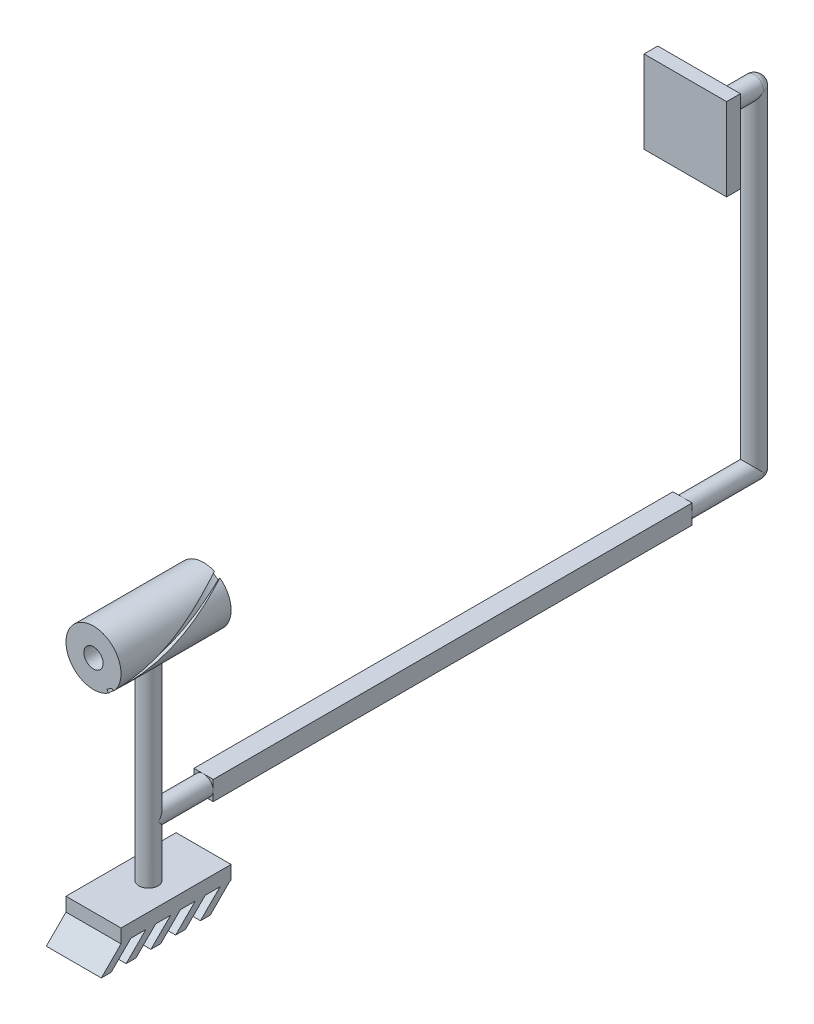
ISO-10303-21;
HEADER;
FILE_DESCRIPTION(('STEP AP214'),'2;1');
FILE_NAME('part.step','',(''),(''),'','','');
FILE_SCHEMA(('AUTOMOTIVE_DESIGN { 1 0 10303 214 1 1 1 1 }'));
ENDSEC;
DATA;
#1=APPLICATION_CONTEXT('core data for automotive mechanical design processes');
#2=APPLICATION_PROTOCOL_DEFINITION('international standard','automotive_design',2000,#1);
#3=PRODUCT_CONTEXT('',#1,'mechanical');
#4=PRODUCT('Part','Part','',(#3));
#5=PRODUCT_RELATED_PRODUCT_CATEGORY('part','',(#4));
#6=PRODUCT_DEFINITION_FORMATION('','',#4);
#7=PRODUCT_DEFINITION_CONTEXT('part definition',#1,'design');
#8=PRODUCT_DEFINITION('design','',#6,#7);
#9=PRODUCT_DEFINITION_SHAPE('','',#8);
#10=(LENGTH_UNIT() NAMED_UNIT(*) SI_UNIT(.MILLI.,.METRE.));
#11=(NAMED_UNIT(*) PLANE_ANGLE_UNIT() SI_UNIT($,.RADIAN.));
#12=(NAMED_UNIT(*) SI_UNIT($,.STERADIAN.) SOLID_ANGLE_UNIT());
#13=UNCERTAINTY_MEASURE_WITH_UNIT(LENGTH_MEASURE(1.E-05),#10,'distance_accuracy_value','');
#14=(GEOMETRIC_REPRESENTATION_CONTEXT(3) GLOBAL_UNCERTAINTY_ASSIGNED_CONTEXT((#13)) GLOBAL_UNIT_ASSIGNED_CONTEXT((#10,
#11,#12)) REPRESENTATION_CONTEXT('',''));
#15=CARTESIAN_POINT('',(0.,0.,0.));
#16=DIRECTION('',(0.,0.,1.));
#17=DIRECTION('',(1.,0.,0.));
#18=AXIS2_PLACEMENT_3D('',#15,#16,#17);
#19=CARTESIAN_POINT('',(0.,0.,-20.));
#20=DIRECTION('',(0.,0.,1.));
#21=DIRECTION('',(1.,0.,0.));
#22=AXIS2_PLACEMENT_3D('',#19,#20,#21);
#23=PLANE('',#22);
#24=CARTESIAN_POINT('',(0.,0.,-20.));
#25=DIRECTION('',(0.,0.,1.));
#26=DIRECTION('',(1.,0.,0.));
#27=AXIS2_PLACEMENT_3D('',#24,#25,#26);
#28=CIRCLE('',#27,3.5);
#29=CARTESIAN_POINT('',(3.5,0.,-20.));
#30=VERTEX_POINT('',#29);
#31=EDGE_CURVE('E343',#30,#30,#28,.T.);
#32=ORIENTED_EDGE('',*,*,#31,.T.);
#33=EDGE_LOOP('',(#32));
#34=FACE_BOUND('',#33,.T.);
#35=CARTESIAN_POINT('',(3.42945332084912,8.49359580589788,-20.));
#36=CARTESIAN_POINT('',(3.47269387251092,8.55260163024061,-20.));
#37=CARTESIAN_POINT('',(3.51593442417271,8.61160745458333,-20.));
#38=CARTESIAN_POINT('',(3.60241552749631,8.72961910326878,-20.));
#39=CARTESIAN_POINT('',(3.64565607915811,8.7886249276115,-20.));
#40=CARTESIAN_POINT('',(3.77275004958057,8.96205667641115,-20.));
#41=CARTESIAN_POINT('',(3.85660346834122,9.07648260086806,-20.));
#42=CARTESIAN_POINT('',(3.94045688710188,9.19090852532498,-20.));
#43=B_SPLINE_CURVE_WITH_KNOTS('',3,(#35,#36,#37,#38,#39,#40,#41,#42),.UNSPECIFIED.,.F.,.F.,(4,2,
2,4),(0.,0.219460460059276,0.438920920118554,0.864505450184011),.UNSPECIFIED.);
#44=CARTESIAN_POINT('',(3.42945332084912,8.49359580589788,-20.));
#45=VERTEX_POINT('',#44);
#46=CARTESIAN_POINT('',(3.94045688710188,9.19090852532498,-20.));
#47=VERTEX_POINT('',#46);
#48=EDGE_CURVE('E52',#45,#47,#43,.T.);
#49=ORIENTED_EDGE('',*,*,#48,.F.);
#50=CARTESIAN_POINT('',(5.24778011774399,7.16109253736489,-20.));
#51=CARTESIAN_POINT('',(5.09391533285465,7.27384747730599,-20.));
#52=CARTESIAN_POINT('',(4.94005054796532,7.38660241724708,-20.));
#53=CARTESIAN_POINT('',(4.63232097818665,7.61211229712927,-20.));
#54=CARTESIAN_POINT('',(4.47845619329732,7.72486723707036,-20.));
#55=CARTESIAN_POINT('',(4.02621204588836,8.05628005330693,-20.));
#56=CARTESIAN_POINT('',(3.72783268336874,8.27493792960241,-20.));
#57=CARTESIAN_POINT('',(3.42945332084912,8.49359580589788,-20.));
#58=B_SPLINE_CURVE_WITH_KNOTS('',3,(#50,#51,#52,#53,#54,#55,#56,#57),.UNSPECIFIED.,.F.,.F.,(4,2,
2,4),(0.,0.572269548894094,1.14453909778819,2.25430195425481),.UNSPECIFIED.);
#59=CARTESIAN_POINT('',(5.24778011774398,7.16109253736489,-20.));
#60=VERTEX_POINT('',#59);
#61=EDGE_CURVE('E11',#60,#45,#58,.T.);
#62=ORIENTED_EDGE('',*,*,#61,.F.);
#63=CARTESIAN_POINT('',(5.91093516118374,8.06603034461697,-20.));
#64=CARTESIAN_POINT('',(5.85481972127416,7.98945551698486,-20.));
#65=CARTESIAN_POINT('',(5.79870428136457,7.91288068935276,-20.));
#66=CARTESIAN_POINT('',(5.68647340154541,7.75973103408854,-20.));
#67=CARTESIAN_POINT('',(5.63035796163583,7.68315620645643,-20.));
#68=CARTESIAN_POINT('',(5.46542172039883,7.45808509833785,-20.));
#69=CARTESIAN_POINT('',(5.35660091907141,7.30958881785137,-20.));
#70=CARTESIAN_POINT('',(5.24778011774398,7.16109253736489,-20.));
#71=B_SPLINE_CURVE_WITH_KNOTS('',3,(#63,#64,#65,#66,#67,#68,#69,#70),.UNSPECIFIED.,.F.,.F.,(4,2,
2,4),(0.,0.284804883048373,0.569609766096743,1.12191222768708),.UNSPECIFIED.);
#72=CARTESIAN_POINT('',(5.91078853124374,8.06613779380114,-20.0000904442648));
#73=VERTEX_POINT('',#72);
#74=EDGE_CURVE('E44',#73,#60,#71,.T.);
#75=ORIENTED_EDGE('',*,*,#74,.F.);
#76=CARTESIAN_POINT('',(0.,0.,-20.));
#77=DIRECTION('',(0.,0.,1.));
#78=DIRECTION('',(1.,0.,0.));
#79=AXIS2_PLACEMENT_3D('',#76,#77,#78);
#80=CIRCLE('',#79,10.);
#81=EDGE_CURVE('E323',#47,#73,#80,.T.);
#82=ORIENTED_EDGE('',*,*,#81,.F.);
#83=EDGE_LOOP('',(#49,#62,#75,#82));
#84=FACE_BOUND('',#83,.T.);
#85=ADVANCED_FACE('F32',(#34,#84),#23,.F.);
#86=CARTESIAN_POINT('',(0.,0.,20.));
#87=DIRECTION('',(0.,0.,-1.));
#88=DIRECTION('',(-1.,0.,0.));
#89=AXIS2_PLACEMENT_3D('',#86,#87,#88);
#90=CYLINDRICAL_SURFACE('',#89,10.);
#91=CARTESIAN_POINT('',(0.,-10.,3.5));
#92=CARTESIAN_POINT('',(0.190419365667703,-10.000002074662,3.5000029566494));
#93=CARTESIAN_POINT('',(0.380817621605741,-9.99451197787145,3.48441032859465));
#94=CARTESIAN_POINT('',(0.755973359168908,-9.97315454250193,3.42266620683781));
#95=CARTESIAN_POINT('',(0.940730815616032,-9.95728715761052,3.37651457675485));
#96=CARTESIAN_POINT('',(1.29914235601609,-9.91689126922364,3.25545106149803));
#97=CARTESIAN_POINT('',(1.47281549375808,-9.89237812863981,3.18059017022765));
#98=CARTESIAN_POINT('',(1.80513664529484,-9.83716899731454,3.00447488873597));
#99=CARTESIAN_POINT('',(1.96378123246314,-9.80647160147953,2.90321449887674));
#100=CARTESIAN_POINT('',(2.26752589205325,-9.74080617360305,2.67317148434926));
#101=CARTESIAN_POINT('',(2.41198196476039,-9.70572841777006,2.54357008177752));
#102=CARTESIAN_POINT('',(2.67761185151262,-9.6358339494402,2.26226333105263));
#103=CARTESIAN_POINT('',(2.79877980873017,-9.60101730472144,2.11055243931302));
#104=CARTESIAN_POINT('',(3.01822956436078,-9.53435354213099,1.78334535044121));
#105=CARTESIAN_POINT('',(3.11564633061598,-9.50263856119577,1.60723944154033));
#106=CARTESIAN_POINT('',(3.27919932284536,-9.44745244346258,1.23985540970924));
#107=CARTESIAN_POINT('',(3.34534622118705,-9.42397849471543,1.04858248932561));
#108=CARTESIAN_POINT('',(3.442016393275,-9.3890943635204,0.663656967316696));
#109=CARTESIAN_POINT('',(3.47375567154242,-9.37727382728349,0.470348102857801));
#110=CARTESIAN_POINT('',(3.5045119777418,-9.36582571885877,0.0808148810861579));
#111=CARTESIAN_POINT('',(3.50354037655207,-9.36619390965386,-0.115408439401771));
#112=CARTESIAN_POINT('',(3.4698409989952,-9.37872426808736,-0.494549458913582));
#113=CARTESIAN_POINT('',(3.43873715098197,-9.3902833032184,-0.677634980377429));
#114=CARTESIAN_POINT('',(3.34831908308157,-9.42290004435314,-1.03580240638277));
#115=CARTESIAN_POINT('',(3.28900115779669,-9.44395899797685,-1.21088325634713));
#116=CARTESIAN_POINT('',(3.14284371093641,-9.49360610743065,-1.55161236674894));
#117=CARTESIAN_POINT('',(3.05554665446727,-9.52231799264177,-1.71704555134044));
#118=CARTESIAN_POINT('',(2.85622688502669,-9.58398812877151,-2.03141194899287));
#119=CARTESIAN_POINT('',(2.74419646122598,-9.61694770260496,-2.18033999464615));
#120=CARTESIAN_POINT('',(2.49093399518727,-9.68573241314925,-2.46654322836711));
#121=CARTESIAN_POINT('',(2.34838607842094,-9.72161293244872,-2.60264324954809));
#122=CARTESIAN_POINT('',(2.04205684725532,-9.79053740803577,-2.84932987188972));
#123=CARTESIAN_POINT('',(1.87827306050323,-9.8235810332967,-2.95991349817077));
#124=CARTESIAN_POINT('',(1.53143472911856,-9.88362313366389,-3.15350599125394));
#125=CARTESIAN_POINT('',(1.34817380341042,-9.91054487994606,-3.2361705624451));
#126=CARTESIAN_POINT('',(0.969175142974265,-9.95474882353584,-3.36912230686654));
#127=CARTESIAN_POINT('',(0.773442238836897,-9.97203472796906,-3.41942193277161));
#128=CARTESIAN_POINT('',(0.384982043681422,-9.9943906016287,-3.48406581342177));
#129=CARTESIAN_POINT('',(0.192549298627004,-9.99999889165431,-3.49999580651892));
#130=CARTESIAN_POINT('',(-0.192296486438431,-10.0000011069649,-3.50000418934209));
#131=CARTESIAN_POINT('',(-0.384709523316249,-9.99439714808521,-3.48408858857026));
#132=CARTESIAN_POINT('',(-0.75751229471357,-9.972960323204,-3.42209465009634));
#133=CARTESIAN_POINT('',(-0.93808952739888,-9.95746630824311,-3.37701486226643));
#134=CARTESIAN_POINT('',(-1.28902504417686,-9.91814590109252,-3.25924618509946));
#135=CARTESIAN_POINT('',(-1.45938200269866,-9.89431843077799,-3.18655372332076));
#136=CARTESIAN_POINT('',(-1.790306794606,-9.8399042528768,-3.01340991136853));
#137=CARTESIAN_POINT('',(-1.95047324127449,-9.80914873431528,-2.91224601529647));
#138=CARTESIAN_POINT('',(-2.25205778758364,-9.74433517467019,-2.68585482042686));
#139=CARTESIAN_POINT('',(-2.39346963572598,-9.71027603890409,-2.56061953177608));
#140=CARTESIAN_POINT('',(-2.66095315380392,-9.64050839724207,-2.28219979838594));
#141=CARTESIAN_POINT('',(-2.78589451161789,-9.60480315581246,-2.12792589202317));
#142=CARTESIAN_POINT('',(-3.00828742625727,-9.53749178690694,-1.79985410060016));
#143=CARTESIAN_POINT('',(-3.10573801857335,-9.50588580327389,-1.62605553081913));
#144=CARTESIAN_POINT('',(-3.27010981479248,-9.45060554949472,-1.26333270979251));
#145=CARTESIAN_POINT('',(-3.33703039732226,-9.42693144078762,-1.07440815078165));
#146=CARTESIAN_POINT('',(-3.43775166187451,-9.39067542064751,-0.686934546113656));
#147=CARTESIAN_POINT('',(-3.47156933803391,-9.37808781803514,-0.488390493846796));
#148=CARTESIAN_POINT('',(-3.50371939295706,-9.36612061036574,-0.0993796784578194));
#149=CARTESIAN_POINT('',(-3.50394730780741,-9.36603546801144,0.0909102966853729));
#150=CARTESIAN_POINT('',(-3.47365100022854,-9.37731326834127,0.468662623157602));
#151=CARTESIAN_POINT('',(-3.44312898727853,-9.38867538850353,0.656125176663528));
#152=CARTESIAN_POINT('',(-3.35359653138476,-9.42101694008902,1.01855095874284));
#153=CARTESIAN_POINT('',(-3.29526105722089,-9.44176794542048,1.19370296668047));
#154=CARTESIAN_POINT('',(-3.15232119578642,-9.49044489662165,1.53185809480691));
#155=CARTESIAN_POINT('',(-3.06771062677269,-9.51837253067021,1.69485834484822));
#156=CARTESIAN_POINT('',(-2.86997020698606,-9.57989875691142,2.0124345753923));
#157=CARTESIAN_POINT('',(-2.75568240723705,-9.61370284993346,2.16624940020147));
#158=CARTESIAN_POINT('',(-2.50372401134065,-9.68237561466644,2.45312762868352));
#159=CARTESIAN_POINT('',(-2.36604648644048,-9.71724459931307,2.58618486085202));
#160=CARTESIAN_POINT('',(-2.0638531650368,-9.78598669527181,2.83378378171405));
#161=CARTESIAN_POINT('',(-1.89841397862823,-9.81974595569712,2.94723445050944));
#162=CARTESIAN_POINT('',(-1.54966762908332,-9.8807802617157,3.14462349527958));
#163=CARTESIAN_POINT('',(-1.36636283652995,-9.90805616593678,3.22856577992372));
#164=CARTESIAN_POINT('',(-0.9890298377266,-9.95276281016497,3.36325721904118));
#165=CARTESIAN_POINT('',(-0.79513954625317,-9.97029715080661,3.41435660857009));
#166=CARTESIAN_POINT('',(-0.400823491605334,-9.9939126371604,3.48272048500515));
#167=CARTESIAN_POINT('',(-0.20040005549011,-9.9999978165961,3.49999688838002));
#168=CARTESIAN_POINT('',(0.,-10.,3.5));
#169=B_SPLINE_CURVE_WITH_KNOTS('',3,(#91,#92,#93,#94,#95,#96,#97,#98,#99,#100,#101,#102,#103,
#104,#105,#106,#107,#108,#109,#110,#111,#112,#113,#114,#115,#116,#117,#118,#119,#120,#121,#122,
#123,#124,#125,#126,#127,#128,#129,#130,#131,#132,#133,#134,#135,#136,#137,#138,#139,#140,#141,
#142,#143,#144,#145,#146,#147,#148,#149,#150,#151,#152,#153,#154,#155,#156,#157,#158,#159,#160,
#161,#162,#163,#164,#165,#166,#167,#168),.UNSPECIFIED.,.T.,.F.,(4,2,2,2,2,2,2,2,2,2,2,2,2,2,2,2,
2,2,2,2,2,2,2,2,2,2,2,2,2,2,2,2,2,2,2,2,2,2,4),(0.,0.570519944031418,1.14104243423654,
1.71055621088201,2.28019953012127,2.86921290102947,3.45837421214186,4.06655384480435,
4.67452575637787,5.26023033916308,5.84573132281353,6.40133800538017,6.95701767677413,
7.5222923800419,8.08774356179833,8.68595781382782,9.28424177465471,9.88965514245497,
10.4948354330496,11.0714375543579,11.6479308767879,12.2056613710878,12.7634640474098,
13.336703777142,13.9101341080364,14.5124257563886,15.1147385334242,15.7170635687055,
16.319079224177,16.8871081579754,17.4550962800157,18.0099524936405,18.5649393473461,
19.1461307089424,19.7274945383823,20.3347978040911,20.9420205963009,21.5426555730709,
22.143078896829),.UNSPECIFIED.);
#170=CARTESIAN_POINT('',(0.,-10.,3.5));
#171=VERTEX_POINT('',#170);
#172=EDGE_CURVE('E542',#171,#171,#169,.T.);
#173=ORIENTED_EDGE('',*,*,#172,.T.);
#174=EDGE_LOOP('',(#173));
#175=FACE_BOUND('',#174,.T.);
#176=CARTESIAN_POINT('',(5.44639035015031,-8.38670567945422,20.));
#177=CARTESIAN_POINT('',(6.925192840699,-7.4263601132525,16.3888888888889));
#178=CARTESIAN_POINT('',(7.98635510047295,-6.01815023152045,12.7777777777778));
#179=CARTESIAN_POINT('',(9.04751736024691,-4.60994034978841,9.16666666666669));
#180=CARTESIAN_POINT('',(9.56304755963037,-2.92371704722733,5.55555555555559));
#181=CARTESIAN_POINT('',(10.0785777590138,-1.23749374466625,1.94444444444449));
#182=CARTESIAN_POINT('',(9.98629534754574,0.523359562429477,-1.66666666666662));
#183=CARTESIAN_POINT('',(9.89401293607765,2.28421286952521,-5.27777777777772));
#184=CARTESIAN_POINT('',(9.20504853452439,3.90731128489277,-8.88888888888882));
#185=CARTESIAN_POINT('',(8.51608413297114,5.53040970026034,-12.4999999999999));
#186=CARTESIAN_POINT('',(7.31353701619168,6.81998360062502,-16.111111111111));
#187=CARTESIAN_POINT('',(6.11098989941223,8.10955750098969,-19.7222222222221));
#188=CARTESIAN_POINT('',(4.53990499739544,8.9100652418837,-23.3333333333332));
#189=CARTESIAN_POINT('',(2.96882009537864,9.71057298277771,-26.9444444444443));
#190=CARTESIAN_POINT('',(1.21869343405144,9.92546151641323,-30.5555555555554));
#191=CARTESIAN_POINT('',(-0.531433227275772,10.1403500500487,-34.1666666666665));
#192=CARTESIAN_POINT('',(-2.24951054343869,9.74370064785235,-37.7777777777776));
#193=CARTESIAN_POINT('',(-3.9675878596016,9.34705124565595,-41.3888888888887));
#194=CARTESIAN_POINT('',(-5.44639035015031,8.38670567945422,-44.9999999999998));
#195=CARTESIAN_POINT('',(-6.925192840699,7.4263601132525,-48.611111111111));
#196=CARTESIAN_POINT('',(-7.98635510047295,6.01815023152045,-52.222222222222));
#197=(BOUNDED_CURVE() B_SPLINE_CURVE(2,(#176,#177,#178,#179,#180,#181,#182,#183,#184,#185,#186,
#187,#188,#189,#190,#191,#192,#193,#194,#195,#196),.UNSPECIFIED.,.F.,
.F.) B_SPLINE_CURVE_WITH_KNOTS((3,2,2,2,2,2,2,2,2,2,3),(0.,0.1,0.2,0.3,0.4,0.5,0.6,0.7,0.8,0.9,
1.),.UNSPECIFIED.) CURVE() GEOMETRIC_REPRESENTATION_ITEM() RATIONAL_B_SPLINE_CURVE((1.,
0.984807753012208,1.,0.984807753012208,1.,0.984807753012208,1.,0.984807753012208,1.,
0.984807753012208,1.,0.984807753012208,1.,0.984807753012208,1.,0.984807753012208,1.,
0.984807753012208,1.,0.984807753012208,1.)) REPRESENTATION_ITEM(''));
#198=CARTESIAN_POINT('',(5.44639035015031,-8.38670567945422,20.));
#199=VERTEX_POINT('',#198);
#200=EDGE_CURVE('E309',#199,#73,#197,.T.);
#201=ORIENTED_EDGE('',*,*,#200,.F.);
#202=CARTESIAN_POINT('',(0.,0.,20.));
#203=DIRECTION('',(0.,0.,1.));
#204=DIRECTION('',(1.,0.,0.));
#205=AXIS2_PLACEMENT_3D('',#202,#203,#204);
#206=CIRCLE('',#205,10.);
#207=CARTESIAN_POINT('',(7.19681327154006,-6.94304535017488,20.));
#208=VERTEX_POINT('',#207);
#209=EDGE_CURVE('E321',#208,#199,#206,.T.);
#210=ORIENTED_EDGE('',*,*,#209,.F.);
#211=CARTESIAN_POINT('',(7.19681327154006,-6.94304535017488,20.));
#212=CARTESIAN_POINT('',(8.42105949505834,-5.67405299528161,16.3888888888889));
#213=CARTESIAN_POINT('',(9.13745369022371,-4.06287337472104,12.7777777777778));
#214=CARTESIAN_POINT('',(9.85384788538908,-2.45169375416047,9.16666666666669));
#215=CARTESIAN_POINT('',(9.97598233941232,-0.692658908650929,5.55555555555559));
#216=CARTESIAN_POINT('',(10.0981167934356,1.06637593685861,1.94444444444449));
#217=CARTESIAN_POINT('',(9.6112602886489,2.76110044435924,-1.66666666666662));
#218=CARTESIAN_POINT('',(9.12440378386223,4.45582495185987,-5.27777777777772));
#219=CARTESIAN_POINT('',(8.08727839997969,5.88183033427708,-8.88888888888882));
#220=CARTESIAN_POINT('',(7.05015301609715,7.30783571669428,-12.4999999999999));
#221=CARTESIAN_POINT('',(5.58785138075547,8.29312467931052,-16.111111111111));
#222=CARTESIAN_POINT('',(4.12554974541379,9.27841364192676,-19.7222222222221));
#223=CARTESIAN_POINT('',(2.41444701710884,9.70414579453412,-23.3333333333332));
#224=CARTESIAN_POINT('',(0.70334428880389,10.1298779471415,-26.9444444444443));
#225=CARTESIAN_POINT('',(-1.05017529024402,9.94470370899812,-30.5555555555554));
#226=CARTESIAN_POINT('',(-2.80369486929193,9.75952947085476,-34.1666666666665));
#227=CARTESIAN_POINT('',(-4.38813095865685,8.98578358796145,-37.7777777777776));
#228=CARTESIAN_POINT('',(-5.97256704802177,8.21203770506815,-41.3888888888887));
#229=CARTESIAN_POINT('',(-7.19681327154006,6.94304535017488,-44.9999999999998));
#230=CARTESIAN_POINT('',(-8.42105949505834,5.67405299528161,-48.611111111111));
#231=CARTESIAN_POINT('',(-9.13745369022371,4.06287337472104,-52.222222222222));
#232=(BOUNDED_CURVE() B_SPLINE_CURVE(2,(#211,#212,#213,#214,#215,#216,#217,#218,#219,#220,#221,
#222,#223,#224,#225,#226,#227,#228,#229,#230,#231),.UNSPECIFIED.,.F.,
.F.) B_SPLINE_CURVE_WITH_KNOTS((3,2,2,2,2,2,2,2,2,2,3),(0.,0.1,0.2,0.3,0.4,0.5,0.6,0.7,0.8,0.9,
1.),.UNSPECIFIED.) CURVE() GEOMETRIC_REPRESENTATION_ITEM() RATIONAL_B_SPLINE_CURVE((1.,
0.984807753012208,1.,0.984807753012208,1.,0.984807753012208,1.,0.984807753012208,1.,
0.984807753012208,1.,0.984807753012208,1.,0.984807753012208,1.,0.984807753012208,1.,
0.984807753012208,1.,0.984807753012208,1.)) REPRESENTATION_ITEM(''));
#233=EDGE_CURVE('E324',#208,#47,#232,.T.);
#234=ORIENTED_EDGE('',*,*,#233,.T.);
#235=ORIENTED_EDGE('',*,*,#81,.T.);
#236=EDGE_LOOP('',(#201,#210,#234,#235));
#237=FACE_BOUND('',#236,.T.);
#238=ADVANCED_FACE('F34',(#175,#237),#90,.T.);
#239=CARTESIAN_POINT('',(0.,60.,-220.));
#240=DIRECTION('',(0.,-1.,0.));
#241=DIRECTION('',(0.,0.,-1.));
#242=AXIS2_PLACEMENT_3D('',#239,#240,#241);
#243=CYLINDRICAL_SURFACE('',#242,3.5);
#244=CARTESIAN_POINT('',(0.,-60.,-220.));
#245=DIRECTION('',(0.,-0.707106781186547,0.707106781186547));
#246=DIRECTION('',(0.,0.707106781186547,0.707106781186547));
#247=AXIS2_PLACEMENT_3D('',#244,#245,#246);
#248=ELLIPSE('',#247,4.94974746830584,3.5);
#249=CARTESIAN_POINT('',(3.5,-60.,-220.));
#250=VERTEX_POINT('',#249);
#251=CARTESIAN_POINT('',(-3.5,-60.,-220.));
#252=VERTEX_POINT('',#251);
#253=EDGE_CURVE('E779',#250,#252,#248,.T.);
#254=ORIENTED_EDGE('',*,*,#253,.F.);
#255=CARTESIAN_POINT('',(0.,-60.,-220.));
#256=DIRECTION('',(0.,1.,0.));
#257=DIRECTION('',(0.,0.,1.));
#258=AXIS2_PLACEMENT_3D('',#255,#256,#257);
#259=CIRCLE('',#258,3.5);
#260=EDGE_CURVE('E774',#250,#252,#259,.T.);
#261=ORIENTED_EDGE('',*,*,#260,.T.);
#262=EDGE_LOOP('',(#254,#261));
#263=FACE_BOUND('',#262,.T.);
#264=CARTESIAN_POINT('',(0.,60.,-220.));
#265=DIRECTION('',(0.,-0.707106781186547,-0.707106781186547));
#266=DIRECTION('',(0.,-0.707106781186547,0.707106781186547));
#267=AXIS2_PLACEMENT_3D('',#264,#265,#266);
#268=ELLIPSE('',#267,4.94974746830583,3.5);
#269=CARTESIAN_POINT('',(-3.5,60.,-220.));
#270=VERTEX_POINT('',#269);
#271=CARTESIAN_POINT('',(3.5,60.,-220.));
#272=VERTEX_POINT('',#271);
#273=EDGE_CURVE('E771',#270,#272,#268,.F.);
#274=ORIENTED_EDGE('',*,*,#273,.F.);
#275=CARTESIAN_POINT('',(0.,60.,-220.));
#276=DIRECTION('',(0.,1.,0.));
#277=DIRECTION('',(0.,0.,1.));
#278=AXIS2_PLACEMENT_3D('',#275,#276,#277);
#279=CIRCLE('',#278,3.5);
#280=EDGE_CURVE('E777',#272,#270,#279,.T.);
#281=ORIENTED_EDGE('',*,*,#280,.F.);
#282=EDGE_LOOP('',(#274,#281));
#283=FACE_BOUND('',#282,.T.);
#284=ADVANCED_FACE('F508',(#263,#283),#243,.T.);
#285=CARTESIAN_POINT('',(0.,-60.,-220.));
#286=DIRECTION('',(0.,0.,1.));
#287=DIRECTION('',(1.,0.,0.));
#288=AXIS2_PLACEMENT_3D('',#285,#286,#287);
#289=CYLINDRICAL_SURFACE('',#288,3.5);
#290=CARTESIAN_POINT('',(0.,-60.,-194.));
#291=DIRECTION('',(0.,0.,-1.));
#292=DIRECTION('',(-1.,0.,0.));
#293=AXIS2_PLACEMENT_3D('',#290,#291,#292);
#294=CIRCLE('',#293,3.5);
#295=CARTESIAN_POINT('',(-3.5,-60.,-194.));
#296=VERTEX_POINT('',#295);
#297=CARTESIAN_POINT('',(0.,-63.5,-194.));
#298=VERTEX_POINT('',#297);
#299=EDGE_CURVE('E345',#296,#298,#294,.F.);
#300=ORIENTED_EDGE('',*,*,#299,.F.);
#301=CARTESIAN_POINT('',(0.,-56.5,-194.));
#302=VERTEX_POINT('',#301);
#303=EDGE_CURVE('E1330',#302,#296,#294,.F.);
#304=ORIENTED_EDGE('',*,*,#303,.F.);
#305=CARTESIAN_POINT('',(3.5,-60.,-194.));
#306=VERTEX_POINT('',#305);
#307=EDGE_CURVE('E60',#306,#302,#294,.F.);
#308=ORIENTED_EDGE('',*,*,#307,.F.);
#309=EDGE_CURVE('E1329',#298,#306,#294,.F.);
#310=ORIENTED_EDGE('',*,*,#309,.F.);
#311=EDGE_LOOP('',(#300,#304,#308,#310));
#312=FACE_BOUND('',#311,.T.);
#313=CARTESIAN_POINT('',(0.,-60.,-220.));
#314=DIRECTION('',(0.,0.,1.));
#315=DIRECTION('',(1.,0.,0.));
#316=AXIS2_PLACEMENT_3D('',#313,#314,#315);
#317=CIRCLE('',#316,3.5);
#318=EDGE_CURVE('E826',#252,#250,#317,.T.);
#319=ORIENTED_EDGE('',*,*,#318,.T.);
#320=ORIENTED_EDGE('',*,*,#253,.T.);
#321=EDGE_LOOP('',(#319,#320));
#322=FACE_BOUND('',#321,.T.);
#323=ADVANCED_FACE('F506',(#312,#322),#289,.T.);
#324=CARTESIAN_POINT('',(0.,-60.,-220.));
#325=DIRECTION('',(1.,0.,0.));
#326=DIRECTION('',(0.,-1.,0.));
#327=AXIS2_PLACEMENT_3D('',#324,#325,#326);
#328=SPHERICAL_SURFACE('',#327,3.5);
#329=ORIENTED_EDGE('',*,*,#318,.F.);
#330=ORIENTED_EDGE('',*,*,#260,.F.);
#331=EDGE_LOOP('',(#329,#330));
#332=FACE_BOUND('',#331,.T.);
#333=ADVANCED_FACE('F502',(#332),#328,.T.);
#334=CARTESIAN_POINT('',(0.,60.,-200.));
#335=DIRECTION('',(0.,0.,-1.));
#336=DIRECTION('',(-1.,0.,0.));
#337=AXIS2_PLACEMENT_3D('',#334,#335,#336);
#338=CYLINDRICAL_SURFACE('',#337,3.5);
#339=CARTESIAN_POINT('',(0.,60.,-200.));
#340=DIRECTION('',(0.,0.,1.));
#341=DIRECTION('',(1.,0.,0.));
#342=AXIS2_PLACEMENT_3D('',#339,#340,#341);
#343=CIRCLE('',#342,3.5);
#344=CARTESIAN_POINT('',(3.5,60.,-200.));
#345=VERTEX_POINT('',#344);
#346=EDGE_CURVE('E768',#345,#345,#343,.T.);
#347=ORIENTED_EDGE('',*,*,#346,.F.);
#348=EDGE_LOOP('',(#347));
#349=FACE_BOUND('',#348,.T.);
#350=CARTESIAN_POINT('',(0.,60.,-220.));
#351=DIRECTION('',(0.,0.,1.));
#352=DIRECTION('',(1.,0.,0.));
#353=AXIS2_PLACEMENT_3D('',#350,#351,#352);
#354=CIRCLE('',#353,3.5);
#355=EDGE_CURVE('E765',#272,#270,#354,.T.);
#356=ORIENTED_EDGE('',*,*,#355,.T.);
#357=ORIENTED_EDGE('',*,*,#273,.T.);
#358=EDGE_LOOP('',(#356,#357));
#359=FACE_BOUND('',#358,.T.);
#360=ADVANCED_FACE('F498',(#349,#359),#338,.T.);
#361=CARTESIAN_POINT('',(0.,60.,-220.));
#362=DIRECTION('',(1.,0.,0.));
#363=DIRECTION('',(0.,1.,0.));
#364=AXIS2_PLACEMENT_3D('',#361,#362,#363);
#365=SPHERICAL_SURFACE('',#364,3.5);
#366=ORIENTED_EDGE('',*,*,#280,.T.);
#367=ORIENTED_EDGE('',*,*,#355,.F.);
#368=EDGE_LOOP('',(#366,#367));
#369=FACE_BOUND('',#368,.T.);
#370=ADVANCED_FACE('F476',(#369),#365,.T.);
#371=CARTESIAN_POINT('',(-15.,45.,-200.));
#372=DIRECTION('',(0.,0.,1.));
#373=DIRECTION('',(1.,0.,0.));
#374=AXIS2_PLACEMENT_3D('',#371,#372,#373);
#375=PLANE('',#374);
#376=DIRECTION('',(0.,-1.,0.));
#377=VECTOR('',#376,1.);
#378=CARTESIAN_POINT('',(-15.,75.,-200.));
#379=LINE('',#378,#377);
#380=CARTESIAN_POINT('',(-15.,75.,-200.));
#381=VERTEX_POINT('',#380);
#382=CARTESIAN_POINT('',(-15.,45.,-200.));
#383=VERTEX_POINT('',#382);
#384=EDGE_CURVE('E730',#381,#383,#379,.T.);
#385=ORIENTED_EDGE('',*,*,#384,.F.);
#386=DIRECTION('',(-1.,0.,0.));
#387=VECTOR('',#386,1.);
#388=CARTESIAN_POINT('',(-15.,75.,-200.));
#389=LINE('',#388,#387);
#390=CARTESIAN_POINT('',(15.,75.,-200.));
#391=VERTEX_POINT('',#390);
#392=EDGE_CURVE('E742',#391,#381,#389,.T.);
#393=ORIENTED_EDGE('',*,*,#392,.F.);
#394=DIRECTION('',(0.,1.,0.));
#395=VECTOR('',#394,1.);
#396=CARTESIAN_POINT('',(15.,75.,-200.));
#397=LINE('',#396,#395);
#398=CARTESIAN_POINT('',(15.,45.,-200.));
#399=VERTEX_POINT('',#398);
#400=EDGE_CURVE('E740',#399,#391,#397,.T.);
#401=ORIENTED_EDGE('',*,*,#400,.F.);
#402=DIRECTION('',(1.,0.,0.));
#403=VECTOR('',#402,1.);
#404=CARTESIAN_POINT('',(-15.,45.,-200.));
#405=LINE('',#404,#403);
#406=EDGE_CURVE('E736',#383,#399,#405,.T.);
#407=ORIENTED_EDGE('',*,*,#406,.F.);
#408=EDGE_LOOP('',(#385,#393,#401,#407));
#409=FACE_BOUND('',#408,.T.);
#410=ORIENTED_EDGE('',*,*,#346,.T.);
#411=EDGE_LOOP('',(#410));
#412=FACE_BOUND('',#411,.T.);
#413=ADVANCED_FACE('F472',(#409,#412),#375,.F.);
#414=CARTESIAN_POINT('',(-15.,75.,-195.));
#415=DIRECTION('',(1.,0.,0.));
#416=DIRECTION('',(0.,1.,0.));
#417=AXIS2_PLACEMENT_3D('',#414,#415,#416);
#418=PLANE('',#417);
#419=ORIENTED_EDGE('',*,*,#384,.T.);
#420=DIRECTION('',(0.,0.,-1.));
#421=VECTOR('',#420,1.);
#422=CARTESIAN_POINT('',(-15.,45.,-195.));
#423=LINE('',#422,#421);
#424=CARTESIAN_POINT('',(-15.,45.,-195.));
#425=VERTEX_POINT('',#424);
#426=EDGE_CURVE('E762',#425,#383,#423,.T.);
#427=ORIENTED_EDGE('',*,*,#426,.F.);
#428=DIRECTION('',(0.,-1.,0.));
#429=VECTOR('',#428,1.);
#430=CARTESIAN_POINT('',(-15.,75.,-195.));
#431=LINE('',#430,#429);
#432=CARTESIAN_POINT('',(-15.,75.,-195.));
#433=VERTEX_POINT('',#432);
#434=EDGE_CURVE('E744',#433,#425,#431,.T.);
#435=ORIENTED_EDGE('',*,*,#434,.F.);
#436=DIRECTION('',(0.,0.,-1.));
#437=VECTOR('',#436,1.);
#438=CARTESIAN_POINT('',(-15.,75.,-195.));
#439=LINE('',#438,#437);
#440=EDGE_CURVE('E753',#433,#381,#439,.T.);
#441=ORIENTED_EDGE('',*,*,#440,.T.);
#442=EDGE_LOOP('',(#419,#427,#435,#441));
#443=FACE_BOUND('',#442,.T.);
#444=ADVANCED_FACE('F475',(#443),#418,.F.);
#445=CARTESIAN_POINT('',(-15.,45.,-195.));
#446=DIRECTION('',(0.,1.,0.));
#447=DIRECTION('',(0.,0.,1.));
#448=AXIS2_PLACEMENT_3D('',#445,#446,#447);
#449=PLANE('',#448);
#450=ORIENTED_EDGE('',*,*,#406,.T.);
#451=DIRECTION('',(0.,0.,-1.));
#452=VECTOR('',#451,1.);
#453=CARTESIAN_POINT('',(15.,45.,-195.));
#454=LINE('',#453,#452);
#455=CARTESIAN_POINT('',(15.,45.,-195.));
#456=VERTEX_POINT('',#455);
#457=EDGE_CURVE('E759',#456,#399,#454,.T.);
#458=ORIENTED_EDGE('',*,*,#457,.F.);
#459=DIRECTION('',(1.,0.,0.));
#460=VECTOR('',#459,1.);
#461=CARTESIAN_POINT('',(-15.,45.,-195.));
#462=LINE('',#461,#460);
#463=EDGE_CURVE('E747',#425,#456,#462,.T.);
#464=ORIENTED_EDGE('',*,*,#463,.F.);
#465=ORIENTED_EDGE('',*,*,#426,.T.);
#466=EDGE_LOOP('',(#450,#458,#464,#465));
#467=FACE_BOUND('',#466,.T.);
#468=ADVANCED_FACE('F488',(#467),#449,.F.);
#469=CARTESIAN_POINT('',(15.,75.,-195.));
#470=DIRECTION('',(-1.,0.,0.));
#471=DIRECTION('',(0.,0.,1.));
#472=AXIS2_PLACEMENT_3D('',#469,#470,#471);
#473=PLANE('',#472);
#474=ORIENTED_EDGE('',*,*,#400,.T.);
#475=DIRECTION('',(0.,0.,-1.));
#476=VECTOR('',#475,1.);
#477=CARTESIAN_POINT('',(15.,75.,-195.));
#478=LINE('',#477,#476);
#479=CARTESIAN_POINT('',(15.,75.,-195.));
#480=VERTEX_POINT('',#479);
#481=EDGE_CURVE('E756',#480,#391,#478,.T.);
#482=ORIENTED_EDGE('',*,*,#481,.F.);
#483=DIRECTION('',(0.,1.,0.));
#484=VECTOR('',#483,1.);
#485=CARTESIAN_POINT('',(15.,75.,-195.));
#486=LINE('',#485,#484);
#487=EDGE_CURVE('E749',#456,#480,#486,.T.);
#488=ORIENTED_EDGE('',*,*,#487,.F.);
#489=ORIENTED_EDGE('',*,*,#457,.T.);
#490=EDGE_LOOP('',(#474,#482,#488,#489));
#491=FACE_BOUND('',#490,.T.);
#492=ADVANCED_FACE('F484',(#491),#473,.F.);
#493=CARTESIAN_POINT('',(-15.,75.,-195.));
#494=DIRECTION('',(0.,-1.,0.));
#495=DIRECTION('',(0.,0.,-1.));
#496=AXIS2_PLACEMENT_3D('',#493,#494,#495);
#497=PLANE('',#496);
#498=ORIENTED_EDGE('',*,*,#392,.T.);
#499=ORIENTED_EDGE('',*,*,#440,.F.);
#500=DIRECTION('',(-1.,0.,0.));
#501=VECTOR('',#500,1.);
#502=CARTESIAN_POINT('',(-15.,75.,-195.));
#503=LINE('',#502,#501);
#504=EDGE_CURVE('E751',#480,#433,#503,.T.);
#505=ORIENTED_EDGE('',*,*,#504,.F.);
#506=ORIENTED_EDGE('',*,*,#481,.T.);
#507=EDGE_LOOP('',(#498,#499,#505,#506));
#508=FACE_BOUND('',#507,.T.);
#509=ADVANCED_FACE('F480',(#508),#497,.F.);
#510=CARTESIAN_POINT('',(-15.,45.,-195.));
#511=DIRECTION('',(0.,0.,1.));
#512=DIRECTION('',(1.,0.,0.));
#513=AXIS2_PLACEMENT_3D('',#510,#511,#512);
#514=PLANE('',#513);
#515=ORIENTED_EDGE('',*,*,#434,.T.);
#516=ORIENTED_EDGE('',*,*,#463,.T.);
#517=ORIENTED_EDGE('',*,*,#487,.T.);
#518=ORIENTED_EDGE('',*,*,#504,.T.);
#519=EDGE_LOOP('',(#515,#516,#517,#518));
#520=FACE_BOUND('',#519,.T.);
#521=ADVANCED_FACE('F405',(#520),#514,.T.);
#522=CARTESIAN_POINT('',(3.5,-56.5,-194.));
#523=DIRECTION('',(-1.,0.,0.));
#524=DIRECTION('',(0.,-1.,0.));
#525=AXIS2_PLACEMENT_3D('',#522,#523,#524);
#526=PLANE('',#525);
#527=DIRECTION('',(0.,-1.,0.));
#528=VECTOR('',#527,1.);
#529=CARTESIAN_POINT('',(3.5,-56.5,-20.));
#530=LINE('',#529,#528);
#531=CARTESIAN_POINT('',(3.5,-56.5,-20.));
#532=VERTEX_POINT('',#531);
#533=CARTESIAN_POINT('',(3.5,-60.,-20.));
#534=VERTEX_POINT('',#533);
#535=EDGE_CURVE('E855',#532,#534,#530,.T.);
#536=ORIENTED_EDGE('',*,*,#535,.T.);
#537=CARTESIAN_POINT('',(3.5,-63.5,-20.));
#538=VERTEX_POINT('',#537);
#539=EDGE_CURVE('E853',#534,#538,#530,.T.);
#540=ORIENTED_EDGE('',*,*,#539,.T.);
#541=DIRECTION('',(0.,0.,1.));
#542=VECTOR('',#541,1.);
#543=CARTESIAN_POINT('',(3.5,-63.5,-194.));
#544=LINE('',#543,#542);
#545=CARTESIAN_POINT('',(3.5,-63.5,-194.));
#546=VERTEX_POINT('',#545);
#547=EDGE_CURVE('E1276',#546,#538,#544,.T.);
#548=ORIENTED_EDGE('',*,*,#547,.F.);
#549=DIRECTION('',(0.,-1.,0.));
#550=VECTOR('',#549,1.);
#551=CARTESIAN_POINT('',(3.5,-56.5,-194.));
#552=LINE('',#551,#550);
#553=EDGE_CURVE('E1313',#306,#546,#552,.T.);
#554=ORIENTED_EDGE('',*,*,#553,.F.);
#555=CARTESIAN_POINT('',(3.5,-56.5,-194.));
#556=VERTEX_POINT('',#555);
#557=EDGE_CURVE('E1328',#556,#306,#552,.T.);
#558=ORIENTED_EDGE('',*,*,#557,.F.);
#559=DIRECTION('',(0.,0.,1.));
#560=VECTOR('',#559,1.);
#561=CARTESIAN_POINT('',(3.5,-56.5,-194.));
#562=LINE('',#561,#560);
#563=EDGE_CURVE('E1268',#556,#532,#562,.T.);
#564=ORIENTED_EDGE('',*,*,#563,.T.);
#565=EDGE_LOOP('',(#536,#540,#548,#554,#558,#564));
#566=FACE_BOUND('',#565,.T.);
#567=ADVANCED_FACE('F401',(#566),#526,.F.);
#568=CARTESIAN_POINT('',(3.5,-63.5,-194.));
#569=DIRECTION('',(0.,1.,0.));
#570=DIRECTION('',(0.,0.,1.));
#571=AXIS2_PLACEMENT_3D('',#568,#569,#570);
#572=PLANE('',#571);
#573=DIRECTION('',(-1.,0.,0.));
#574=VECTOR('',#573,1.);
#575=CARTESIAN_POINT('',(3.5,-63.5,-20.));
#576=LINE('',#575,#574);
#577=CARTESIAN_POINT('',(0.,-63.5,-20.));
#578=VERTEX_POINT('',#577);
#579=EDGE_CURVE('E1307',#538,#578,#576,.T.);
#580=ORIENTED_EDGE('',*,*,#579,.T.);
#581=CARTESIAN_POINT('',(-3.5,-63.5,-20.));
#582=VERTEX_POINT('',#581);
#583=EDGE_CURVE('E1321',#578,#582,#576,.T.);
#584=ORIENTED_EDGE('',*,*,#583,.T.);
#585=DIRECTION('',(0.,0.,1.));
#586=VECTOR('',#585,1.);
#587=CARTESIAN_POINT('',(-3.5,-63.5,-194.));
#588=LINE('',#587,#586);
#589=CARTESIAN_POINT('',(-3.5,-63.5,-194.));
#590=VERTEX_POINT('',#589);
#591=EDGE_CURVE('E1274',#590,#582,#588,.T.);
#592=ORIENTED_EDGE('',*,*,#591,.F.);
#593=DIRECTION('',(-1.,0.,0.));
#594=VECTOR('',#593,1.);
#595=CARTESIAN_POINT('',(3.5,-63.5,-194.));
#596=LINE('',#595,#594);
#597=EDGE_CURVE('E1254',#298,#590,#596,.T.);
#598=ORIENTED_EDGE('',*,*,#597,.F.);
#599=EDGE_CURVE('E1263',#546,#298,#596,.T.);
#600=ORIENTED_EDGE('',*,*,#599,.F.);
#601=ORIENTED_EDGE('',*,*,#547,.T.);
#602=EDGE_LOOP('',(#580,#584,#592,#598,#600,#601));
#603=FACE_BOUND('',#602,.T.);
#604=ADVANCED_FACE('F397',(#603),#572,.F.);
#605=CARTESIAN_POINT('',(-3.5,-56.5,-194.));
#606=DIRECTION('',(1.,0.,0.));
#607=DIRECTION('',(0.,1.,0.));
#608=AXIS2_PLACEMENT_3D('',#605,#606,#607);
#609=PLANE('',#608);
#610=DIRECTION('',(0.,1.,0.));
#611=VECTOR('',#610,1.);
#612=CARTESIAN_POINT('',(-3.5,-56.5,-20.));
#613=LINE('',#612,#611);
#614=CARTESIAN_POINT('',(-3.5,-60.,-20.));
#615=VERTEX_POINT('',#614);
#616=EDGE_CURVE('E1322',#582,#615,#613,.T.);
#617=ORIENTED_EDGE('',*,*,#616,.T.);
#618=CARTESIAN_POINT('',(-3.5,-56.5,-20.));
#619=VERTEX_POINT('',#618);
#620=EDGE_CURVE('E1320',#615,#619,#613,.T.);
#621=ORIENTED_EDGE('',*,*,#620,.T.);
#622=DIRECTION('',(0.,0.,1.));
#623=VECTOR('',#622,1.);
#624=CARTESIAN_POINT('',(-3.5,-56.5,-194.));
#625=LINE('',#624,#623);
#626=CARTESIAN_POINT('',(-3.5,-56.5,-194.));
#627=VERTEX_POINT('',#626);
#628=EDGE_CURVE('E1271',#627,#619,#625,.T.);
#629=ORIENTED_EDGE('',*,*,#628,.F.);
#630=DIRECTION('',(0.,1.,0.));
#631=VECTOR('',#630,1.);
#632=CARTESIAN_POINT('',(-3.5,-56.5,-194.));
#633=LINE('',#632,#631);
#634=EDGE_CURVE('E1259',#296,#627,#633,.T.);
#635=ORIENTED_EDGE('',*,*,#634,.F.);
#636=EDGE_CURVE('E1252',#590,#296,#633,.T.);
#637=ORIENTED_EDGE('',*,*,#636,.F.);
#638=ORIENTED_EDGE('',*,*,#591,.T.);
#639=EDGE_LOOP('',(#617,#621,#629,#635,#637,#638));
#640=FACE_BOUND('',#639,.T.);
#641=ADVANCED_FACE('F393',(#640),#609,.F.);
#642=CARTESIAN_POINT('',(3.5,-56.5,-194.));
#643=DIRECTION('',(0.,-1.,0.));
#644=DIRECTION('',(0.,0.,-1.));
#645=AXIS2_PLACEMENT_3D('',#642,#643,#644);
#646=PLANE('',#645);
#647=DIRECTION('',(1.,0.,0.));
#648=VECTOR('',#647,1.);
#649=CARTESIAN_POINT('',(3.5,-56.5,-20.));
#650=LINE('',#649,#648);
#651=CARTESIAN_POINT('',(0.,-56.5,-20.));
#652=VERTEX_POINT('',#651);
#653=EDGE_CURVE('E1326',#619,#652,#650,.T.);
#654=ORIENTED_EDGE('',*,*,#653,.T.);
#655=EDGE_CURVE('E1325',#652,#532,#650,.T.);
#656=ORIENTED_EDGE('',*,*,#655,.T.);
#657=ORIENTED_EDGE('',*,*,#563,.F.);
#658=DIRECTION('',(1.,0.,0.));
#659=VECTOR('',#658,1.);
#660=CARTESIAN_POINT('',(3.5,-56.5,-194.));
#661=LINE('',#660,#659);
#662=EDGE_CURVE('E1258',#302,#556,#661,.T.);
#663=ORIENTED_EDGE('',*,*,#662,.F.);
#664=EDGE_CURVE('E1261',#627,#302,#661,.T.);
#665=ORIENTED_EDGE('',*,*,#664,.F.);
#666=ORIENTED_EDGE('',*,*,#628,.T.);
#667=EDGE_LOOP('',(#654,#656,#657,#663,#665,#666));
#668=FACE_BOUND('',#667,.T.);
#669=ADVANCED_FACE('F390',(#668),#646,.F.);
#670=CARTESIAN_POINT('',(3.5,-63.5,-194.));
#671=DIRECTION('',(0.,0.,-1.));
#672=DIRECTION('',(-1.,0.,0.));
#673=AXIS2_PLACEMENT_3D('',#670,#671,#672);
#674=PLANE('',#673);
#675=ORIENTED_EDGE('',*,*,#636,.T.);
#676=ORIENTED_EDGE('',*,*,#299,.T.);
#677=ORIENTED_EDGE('',*,*,#597,.T.);
#678=EDGE_LOOP('',(#675,#676,#677));
#679=FACE_BOUND('',#678,.T.);
#680=ADVANCED_FACE('F388',(#679),#674,.T.);
#681=ORIENTED_EDGE('',*,*,#599,.T.);
#682=ORIENTED_EDGE('',*,*,#309,.T.);
#683=ORIENTED_EDGE('',*,*,#553,.T.);
#684=EDGE_LOOP('',(#681,#682,#683));
#685=FACE_BOUND('',#684,.T.);
#686=ADVANCED_FACE('F1047',(#685),#674,.T.);
#687=ORIENTED_EDGE('',*,*,#557,.T.);
#688=ORIENTED_EDGE('',*,*,#307,.T.);
#689=ORIENTED_EDGE('',*,*,#662,.T.);
#690=EDGE_LOOP('',(#687,#688,#689));
#691=FACE_BOUND('',#690,.T.);
#692=ADVANCED_FACE('F389',(#691),#674,.T.);
#693=CARTESIAN_POINT('',(3.5,-63.5,-20.));
#694=DIRECTION('',(0.,0.,-1.));
#695=DIRECTION('',(-1.,0.,0.));
#696=AXIS2_PLACEMENT_3D('',#693,#694,#695);
#697=PLANE('',#696);
#698=CARTESIAN_POINT('',(0.,-60.,-20.));
#699=DIRECTION('',(0.,0.,-1.));
#700=DIRECTION('',(-1.,0.,0.));
#701=AXIS2_PLACEMENT_3D('',#698,#699,#700);
#702=CIRCLE('',#701,3.5);
#703=EDGE_CURVE('E1332',#615,#578,#702,.F.);
#704=ORIENTED_EDGE('',*,*,#703,.F.);
#705=ORIENTED_EDGE('',*,*,#616,.F.);
#706=ORIENTED_EDGE('',*,*,#583,.F.);
#707=EDGE_LOOP('',(#704,#705,#706));
#708=FACE_BOUND('',#707,.T.);
#709=ADVANCED_FACE('F383',(#708),#697,.F.);
#710=EDGE_CURVE('E1318',#578,#534,#702,.F.);
#711=ORIENTED_EDGE('',*,*,#710,.F.);
#712=ORIENTED_EDGE('',*,*,#579,.F.);
#713=ORIENTED_EDGE('',*,*,#539,.F.);
#714=EDGE_LOOP('',(#711,#712,#713));
#715=FACE_BOUND('',#714,.T.);
#716=ADVANCED_FACE('F1028',(#715),#697,.F.);
#717=EDGE_CURVE('E1334',#534,#652,#702,.F.);
#718=ORIENTED_EDGE('',*,*,#717,.F.);
#719=ORIENTED_EDGE('',*,*,#535,.F.);
#720=ORIENTED_EDGE('',*,*,#655,.F.);
#721=EDGE_LOOP('',(#718,#719,#720));
#722=FACE_BOUND('',#721,.T.);
#723=ADVANCED_FACE('F384',(#722),#697,.F.);
#724=ORIENTED_EDGE('',*,*,#664,.T.);
#725=ORIENTED_EDGE('',*,*,#303,.T.);
#726=ORIENTED_EDGE('',*,*,#634,.T.);
#727=EDGE_LOOP('',(#724,#725,#726));
#728=FACE_BOUND('',#727,.T.);
#729=ADVANCED_FACE('F381',(#728),#674,.T.);
#730=EDGE_CURVE('E332',#652,#615,#702,.F.);
#731=ORIENTED_EDGE('',*,*,#730,.F.);
#732=ORIENTED_EDGE('',*,*,#653,.F.);
#733=ORIENTED_EDGE('',*,*,#620,.F.);
#734=EDGE_LOOP('',(#731,#732,#733));
#735=FACE_BOUND('',#734,.T.);
#736=ADVANCED_FACE('F371',(#735),#697,.F.);
#737=CARTESIAN_POINT('',(9.99999999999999,-85.,20.));
#738=DIRECTION('',(0.,1.,0.));
#739=DIRECTION('',(0.,0.,1.));
#740=AXIS2_PLACEMENT_3D('',#737,#738,#739);
#741=PLANE('',#740);
#742=DIRECTION('',(0.,0.,1.));
#743=VECTOR('',#742,1.);
#744=CARTESIAN_POINT('',(9.99999999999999,-85.,20.));
#745=LINE('',#744,#743);
#746=CARTESIAN_POINT('',(10.,-85.,-20.));
#747=VERTEX_POINT('',#746);
#748=CARTESIAN_POINT('',(10.,-85.,-19.5769185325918));
#749=VERTEX_POINT('',#748);
#750=EDGE_CURVE('E552',#747,#749,#745,.T.);
#751=ORIENTED_EDGE('',*,*,#750,.T.);
#752=DIRECTION('',(1.,0.,0.));
#753=VECTOR('',#752,1.);
#754=CARTESIAN_POINT('',(-22.8967631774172,-85.,-19.5769185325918));
#755=LINE('',#754,#753);
#756=CARTESIAN_POINT('',(-9.99999999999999,-85.,-19.5769185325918));
#757=VERTEX_POINT('',#756);
#758=EDGE_CURVE('E616',#757,#749,#755,.T.);
#759=ORIENTED_EDGE('',*,*,#758,.F.);
#760=DIRECTION('',(0.,0.,-1.));
#761=VECTOR('',#760,1.);
#762=CARTESIAN_POINT('',(-10.,-85.,20.));
#763=LINE('',#762,#761);
#764=CARTESIAN_POINT('',(-9.99999999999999,-85.,-20.));
#765=VERTEX_POINT('',#764);
#766=EDGE_CURVE('E581',#757,#765,#763,.T.);
#767=ORIENTED_EDGE('',*,*,#766,.T.);
#768=DIRECTION('',(1.,0.,0.));
#769=VECTOR('',#768,1.);
#770=CARTESIAN_POINT('',(10.,-85.,-20.));
#771=LINE('',#770,#769);
#772=EDGE_CURVE('E585',#765,#747,#771,.T.);
#773=ORIENTED_EDGE('',*,*,#772,.T.);
#774=EDGE_LOOP('',(#751,#759,#767,#773));
#775=FACE_BOUND('',#774,.T.);
#776=ADVANCED_FACE('F380',(#775),#741,.F.);
#777=CARTESIAN_POINT('',(-22.8967631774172,-92.1538370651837,-12.4230814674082));
#778=DIRECTION('',(0.,-0.707106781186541,-0.707106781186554));
#779=DIRECTION('',(0.,0.707106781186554,-0.707106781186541));
#780=AXIS2_PLACEMENT_3D('',#777,#778,#779);
#781=PLANE('',#780);
#782=DIRECTION('',(0.,-0.707106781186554,0.707106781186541));
#783=VECTOR('',#782,1.);
#784=CARTESIAN_POINT('',(-10.,-92.1538370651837,-12.4230814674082));
#785=LINE('',#784,#783);
#786=CARTESIAN_POINT('',(-10.,-92.1538370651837,-12.4230814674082));
#787=VERTEX_POINT('',#786);
#788=EDGE_CURVE('E611',#757,#787,#785,.T.);
#789=ORIENTED_EDGE('',*,*,#788,.F.);
#790=ORIENTED_EDGE('',*,*,#758,.T.);
#791=DIRECTION('',(0.,0.707106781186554,-0.707106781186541));
#792=VECTOR('',#791,1.);
#793=CARTESIAN_POINT('',(10.,-92.1538370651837,-12.4230814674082));
#794=LINE('',#793,#792);
#795=CARTESIAN_POINT('',(10.,-92.1538370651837,-12.4230814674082));
#796=VERTEX_POINT('',#795);
#797=EDGE_CURVE('E623',#796,#749,#794,.T.);
#798=ORIENTED_EDGE('',*,*,#797,.F.);
#799=DIRECTION('',(1.,0.,0.));
#800=VECTOR('',#799,1.);
#801=CARTESIAN_POINT('',(-22.8967631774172,-92.1538370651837,-12.4230814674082));
#802=LINE('',#801,#800);
#803=EDGE_CURVE('E620',#787,#796,#802,.T.);
#804=ORIENTED_EDGE('',*,*,#803,.F.);
#805=EDGE_LOOP('',(#789,#790,#798,#804));
#806=FACE_BOUND('',#805,.T.);
#807=ADVANCED_FACE('F407',(#806),#781,.T.);
#808=CARTESIAN_POINT('',(-22.8967631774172,-92.1538370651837,-8.84616293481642));
#809=DIRECTION('',(0.,-1.,0.));
#810=DIRECTION('',(0.,0.,-1.));
#811=AXIS2_PLACEMENT_3D('',#808,#809,#810);
#812=PLANE('',#811);
#813=DIRECTION('',(0.,0.,1.));
#814=VECTOR('',#813,1.);
#815=CARTESIAN_POINT('',(-10.,-92.1538370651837,-8.84616293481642));
#816=LINE('',#815,#814);
#817=CARTESIAN_POINT('',(-10.,-92.1538370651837,-8.84616293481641));
#818=VERTEX_POINT('',#817);
#819=EDGE_CURVE('E609',#787,#818,#816,.T.);
#820=ORIENTED_EDGE('',*,*,#819,.F.);
#821=ORIENTED_EDGE('',*,*,#803,.T.);
#822=DIRECTION('',(0.,0.,-1.));
#823=VECTOR('',#822,1.);
#824=CARTESIAN_POINT('',(10.,-92.1538370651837,-8.84616293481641));
#825=LINE('',#824,#823);
#826=CARTESIAN_POINT('',(10.,-92.1538370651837,-8.84616293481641));
#827=VERTEX_POINT('',#826);
#828=EDGE_CURVE('E1279',#827,#796,#825,.T.);
#829=ORIENTED_EDGE('',*,*,#828,.F.);
#830=DIRECTION('',(1.,0.,0.));
#831=VECTOR('',#830,1.);
#832=CARTESIAN_POINT('',(-22.8967631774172,-92.1538370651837,-8.84616293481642));
#833=LINE('',#832,#831);
#834=EDGE_CURVE('E627',#818,#827,#833,.T.);
#835=ORIENTED_EDGE('',*,*,#834,.F.);
#836=EDGE_LOOP('',(#820,#821,#829,#835));
#837=FACE_BOUND('',#836,.T.);
#838=ADVANCED_FACE('F410',(#837),#812,.T.);
#839=CARTESIAN_POINT('',(-22.8967631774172,-85.,-16.));
#840=DIRECTION('',(0.,0.707106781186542,0.707106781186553));
#841=DIRECTION('',(0.,-0.707106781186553,0.707106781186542));
#842=AXIS2_PLACEMENT_3D('',#839,#840,#841);
#843=PLANE('',#842);
#844=DIRECTION('',(0.,0.707106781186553,-0.707106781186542));
#845=VECTOR('',#844,1.);
#846=CARTESIAN_POINT('',(-9.99999999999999,-85.,-16.));
#847=LINE('',#846,#845);
#848=CARTESIAN_POINT('',(-9.99999999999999,-85.,-16.));
#849=VERTEX_POINT('',#848);
#850=EDGE_CURVE('E607',#818,#849,#847,.T.);
#851=ORIENTED_EDGE('',*,*,#850,.F.);
#852=ORIENTED_EDGE('',*,*,#834,.T.);
#853=DIRECTION('',(0.,-0.707106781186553,0.707106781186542));
#854=VECTOR('',#853,1.);
#855=CARTESIAN_POINT('',(10.,-85.,-16.));
#856=LINE('',#855,#854);
#857=CARTESIAN_POINT('',(10.,-85.,-16.));
#858=VERTEX_POINT('',#857);
#859=EDGE_CURVE('E615',#858,#827,#856,.T.);
#860=ORIENTED_EDGE('',*,*,#859,.F.);
#861=DIRECTION('',(1.,0.,0.));
#862=VECTOR('',#861,1.);
#863=CARTESIAN_POINT('',(-22.8967631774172,-85.,-16.));
#864=LINE('',#863,#862);
#865=EDGE_CURVE('E601',#849,#858,#864,.T.);
#866=ORIENTED_EDGE('',*,*,#865,.F.);
#867=EDGE_LOOP('',(#851,#852,#860,#866));
#868=FACE_BOUND('',#867,.T.);
#869=ADVANCED_FACE('F414',(#868),#843,.T.);
#870=CARTESIAN_POINT('',(-10.,-85.,-10.5769185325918));
#871=VERTEX_POINT('',#870);
#872=EDGE_CURVE('E580',#871,#849,#763,.T.);
#873=ORIENTED_EDGE('',*,*,#872,.T.);
#874=ORIENTED_EDGE('',*,*,#865,.T.);
#875=CARTESIAN_POINT('',(10.,-85.,-10.5769185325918));
#876=VERTEX_POINT('',#875);
#877=EDGE_CURVE('E556',#858,#876,#745,.T.);
#878=ORIENTED_EDGE('',*,*,#877,.T.);
#879=DIRECTION('',(1.,0.,0.));
#880=VECTOR('',#879,1.);
#881=CARTESIAN_POINT('',(-22.8967631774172,-85.,-10.5769185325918));
#882=LINE('',#881,#880);
#883=EDGE_CURVE('E604',#871,#876,#882,.T.);
#884=ORIENTED_EDGE('',*,*,#883,.F.);
#885=EDGE_LOOP('',(#873,#874,#878,#884));
#886=FACE_BOUND('',#885,.T.);
#887=ADVANCED_FACE('F418',(#886),#741,.F.);
#888=CARTESIAN_POINT('',(-22.8967631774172,-92.1538370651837,-3.42308146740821));
#889=DIRECTION('',(0.,-0.707106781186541,-0.707106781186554));
#890=DIRECTION('',(0.,0.707106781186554,-0.707106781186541));
#891=AXIS2_PLACEMENT_3D('',#888,#889,#890);
#892=PLANE('',#891);
#893=DIRECTION('',(0.,-0.707106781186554,0.707106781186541));
#894=VECTOR('',#893,1.);
#895=CARTESIAN_POINT('',(-10.,-92.1538370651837,-3.42308146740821));
#896=LINE('',#895,#894);
#897=CARTESIAN_POINT('',(-10.,-92.1538370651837,-3.42308146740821));
#898=VERTEX_POINT('',#897);
#899=EDGE_CURVE('E631',#871,#898,#896,.T.);
#900=ORIENTED_EDGE('',*,*,#899,.F.);
#901=ORIENTED_EDGE('',*,*,#883,.T.);
#902=DIRECTION('',(0.,0.707106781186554,-0.707106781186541));
#903=VECTOR('',#902,1.);
#904=CARTESIAN_POINT('',(10.,-92.1538370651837,-3.42308146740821));
#905=LINE('',#904,#903);
#906=CARTESIAN_POINT('',(10.,-92.1538370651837,-3.42308146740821));
#907=VERTEX_POINT('',#906);
#908=EDGE_CURVE('E642',#907,#876,#905,.T.);
#909=ORIENTED_EDGE('',*,*,#908,.F.);
#910=DIRECTION('',(1.,0.,0.));
#911=VECTOR('',#910,1.);
#912=CARTESIAN_POINT('',(-22.8967631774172,-92.1538370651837,-3.42308146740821));
#913=LINE('',#912,#911);
#914=EDGE_CURVE('E648',#898,#907,#913,.T.);
#915=ORIENTED_EDGE('',*,*,#914,.F.);
#916=EDGE_LOOP('',(#900,#901,#909,#915));
#917=FACE_BOUND('',#916,.T.);
#918=ADVANCED_FACE('F420',(#917),#892,.T.);
#919=CARTESIAN_POINT('',(-22.8967631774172,-92.1538370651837,0.153837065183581));
#920=DIRECTION('',(0.,-1.,0.));
#921=DIRECTION('',(0.,0.,-1.));
#922=AXIS2_PLACEMENT_3D('',#919,#920,#921);
#923=PLANE('',#922);
#924=DIRECTION('',(0.,0.,1.));
#925=VECTOR('',#924,1.);
#926=CARTESIAN_POINT('',(-10.,-92.1538370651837,0.153837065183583));
#927=LINE('',#926,#925);
#928=CARTESIAN_POINT('',(-10.,-92.1538370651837,0.153837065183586));
#929=VERTEX_POINT('',#928);
#930=EDGE_CURVE('E636',#898,#929,#927,.T.);
#931=ORIENTED_EDGE('',*,*,#930,.F.);
#932=ORIENTED_EDGE('',*,*,#914,.T.);
#933=DIRECTION('',(0.,0.,-1.));
#934=VECTOR('',#933,1.);
#935=CARTESIAN_POINT('',(10.,-92.1538370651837,0.153837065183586));
#936=LINE('',#935,#934);
#937=CARTESIAN_POINT('',(10.,-92.1538370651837,0.153837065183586));
#938=VERTEX_POINT('',#937);
#939=EDGE_CURVE('E639',#938,#907,#936,.T.);
#940=ORIENTED_EDGE('',*,*,#939,.F.);
#941=DIRECTION('',(1.,0.,0.));
#942=VECTOR('',#941,1.);
#943=CARTESIAN_POINT('',(-22.8967631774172,-92.1538370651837,0.153837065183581));
#944=LINE('',#943,#942);
#945=EDGE_CURVE('E645',#929,#938,#944,.T.);
#946=ORIENTED_EDGE('',*,*,#945,.F.);
#947=EDGE_LOOP('',(#931,#932,#940,#946));
#948=FACE_BOUND('',#947,.T.);
#949=ADVANCED_FACE('F423',(#948),#923,.T.);
#950=CARTESIAN_POINT('',(-22.8967631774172,-85.,-7.));
#951=DIRECTION('',(0.,0.707106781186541,0.707106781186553));
#952=DIRECTION('',(0.,-0.707106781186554,0.707106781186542));
#953=AXIS2_PLACEMENT_3D('',#950,#951,#952);
#954=PLANE('',#953);
#955=DIRECTION('',(0.,0.707106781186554,-0.707106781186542));
#956=VECTOR('',#955,1.);
#957=CARTESIAN_POINT('',(-10.,-85.,-7.));
#958=LINE('',#957,#956);
#959=CARTESIAN_POINT('',(-10.,-85.,-6.99999999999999));
#960=VERTEX_POINT('',#959);
#961=EDGE_CURVE('E633',#929,#960,#958,.T.);
#962=ORIENTED_EDGE('',*,*,#961,.F.);
#963=ORIENTED_EDGE('',*,*,#945,.T.);
#964=DIRECTION('',(0.,-0.707106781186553,0.707106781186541));
#965=VECTOR('',#964,1.);
#966=CARTESIAN_POINT('',(10.,-85.,-6.99999999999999));
#967=LINE('',#966,#965);
#968=CARTESIAN_POINT('',(10.,-85.,-7.));
#969=VERTEX_POINT('',#968);
#970=EDGE_CURVE('E630',#969,#938,#967,.T.);
#971=ORIENTED_EDGE('',*,*,#970,.F.);
#972=DIRECTION('',(1.,0.,0.));
#973=VECTOR('',#972,1.);
#974=CARTESIAN_POINT('',(-22.8967631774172,-85.,-7.));
#975=LINE('',#974,#973);
#976=EDGE_CURVE('E634',#960,#969,#975,.T.);
#977=ORIENTED_EDGE('',*,*,#976,.F.);
#978=EDGE_LOOP('',(#962,#963,#971,#977));
#979=FACE_BOUND('',#978,.T.);
#980=ADVANCED_FACE('F427',(#979),#954,.T.);
#981=CARTESIAN_POINT('',(-10.,-85.,-1.57691853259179));
#982=VERTEX_POINT('',#981);
#983=EDGE_CURVE('E593',#982,#960,#763,.T.);
#984=ORIENTED_EDGE('',*,*,#983,.T.);
#985=ORIENTED_EDGE('',*,*,#976,.T.);
#986=CARTESIAN_POINT('',(10.,-85.,-1.57691853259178));
#987=VERTEX_POINT('',#986);
#988=EDGE_CURVE('E578',#969,#987,#745,.T.);
#989=ORIENTED_EDGE('',*,*,#988,.T.);
#990=DIRECTION('',(1.,0.,0.));
#991=VECTOR('',#990,1.);
#992=CARTESIAN_POINT('',(-22.8967631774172,-85.,-1.57691853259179));
#993=LINE('',#992,#991);
#994=EDGE_CURVE('E670',#982,#987,#993,.T.);
#995=ORIENTED_EDGE('',*,*,#994,.F.);
#996=EDGE_LOOP('',(#984,#985,#989,#995));
#997=FACE_BOUND('',#996,.T.);
#998=ADVANCED_FACE('F431',(#997),#741,.F.);
#999=CARTESIAN_POINT('',(-22.8967631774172,-92.1538370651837,5.57691853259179));
#1000=DIRECTION('',(0.,-0.707106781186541,-0.707106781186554));
#1001=DIRECTION('',(0.,0.707106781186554,-0.707106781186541));
#1002=AXIS2_PLACEMENT_3D('',#999,#1000,#1001);
#1003=PLANE('',#1002);
#1004=DIRECTION('',(0.,-0.707106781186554,0.707106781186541));
#1005=VECTOR('',#1004,1.);
#1006=CARTESIAN_POINT('',(-10.,-92.1538370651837,5.57691853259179));
#1007=LINE('',#1006,#1005);
#1008=CARTESIAN_POINT('',(-10.,-92.1538370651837,5.57691853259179));
#1009=VERTEX_POINT('',#1008);
#1010=EDGE_CURVE('E653',#982,#1009,#1007,.T.);
#1011=ORIENTED_EDGE('',*,*,#1010,.F.);
#1012=ORIENTED_EDGE('',*,*,#994,.T.);
#1013=DIRECTION('',(0.,0.707106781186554,-0.707106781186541));
#1014=VECTOR('',#1013,1.);
#1015=CARTESIAN_POINT('',(10.,-92.1538370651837,5.57691853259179));
#1016=LINE('',#1015,#1014);
#1017=CARTESIAN_POINT('',(10.,-92.1538370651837,5.57691853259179));
#1018=VERTEX_POINT('',#1017);
#1019=EDGE_CURVE('E665',#1018,#987,#1016,.T.);
#1020=ORIENTED_EDGE('',*,*,#1019,.F.);
#1021=DIRECTION('',(1.,0.,0.));
#1022=VECTOR('',#1021,1.);
#1023=CARTESIAN_POINT('',(-22.8967631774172,-92.1538370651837,5.57691853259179));
#1024=LINE('',#1023,#1022);
#1025=EDGE_CURVE('E673',#1009,#1018,#1024,.T.);
#1026=ORIENTED_EDGE('',*,*,#1025,.F.);
#1027=EDGE_LOOP('',(#1011,#1012,#1020,#1026));
#1028=FACE_BOUND('',#1027,.T.);
#1029=ADVANCED_FACE('F433',(#1028),#1003,.T.);
#1030=CARTESIAN_POINT('',(-22.8967631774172,-92.1538370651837,9.15383706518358));
#1031=DIRECTION('',(0.,-1.,0.));
#1032=DIRECTION('',(0.,0.,-1.));
#1033=AXIS2_PLACEMENT_3D('',#1030,#1031,#1032);
#1034=PLANE('',#1033);
#1035=DIRECTION('',(0.,0.,1.));
#1036=VECTOR('',#1035,1.);
#1037=CARTESIAN_POINT('',(-10.,-92.1538370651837,9.15383706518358));
#1038=LINE('',#1037,#1036);
#1039=CARTESIAN_POINT('',(-10.,-92.1538370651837,9.15383706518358));
#1040=VERTEX_POINT('',#1039);
#1041=EDGE_CURVE('E659',#1009,#1040,#1038,.T.);
#1042=ORIENTED_EDGE('',*,*,#1041,.F.);
#1043=ORIENTED_EDGE('',*,*,#1025,.T.);
#1044=DIRECTION('',(0.,0.,-1.));
#1045=VECTOR('',#1044,1.);
#1046=CARTESIAN_POINT('',(10.,-92.1538370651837,9.15383706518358));
#1047=LINE('',#1046,#1045);
#1048=CARTESIAN_POINT('',(10.,-92.1538370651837,9.15383706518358));
#1049=VERTEX_POINT('',#1048);
#1050=EDGE_CURVE('E662',#1049,#1018,#1047,.T.);
#1051=ORIENTED_EDGE('',*,*,#1050,.F.);
#1052=DIRECTION('',(1.,0.,0.));
#1053=VECTOR('',#1052,1.);
#1054=CARTESIAN_POINT('',(-22.8967631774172,-92.1538370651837,9.15383706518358));
#1055=LINE('',#1054,#1053);
#1056=EDGE_CURVE('E668',#1040,#1049,#1055,.T.);
#1057=ORIENTED_EDGE('',*,*,#1056,.F.);
#1058=EDGE_LOOP('',(#1042,#1043,#1051,#1057));
#1059=FACE_BOUND('',#1058,.T.);
#1060=ADVANCED_FACE('F436',(#1059),#1034,.T.);
#1061=CARTESIAN_POINT('',(-22.8967631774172,-85.,2.));
#1062=DIRECTION('',(0.,0.707106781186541,0.707106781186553));
#1063=DIRECTION('',(0.,-0.707106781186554,0.707106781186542));
#1064=AXIS2_PLACEMENT_3D('',#1061,#1062,#1063);
#1065=PLANE('',#1064);
#1066=DIRECTION('',(0.,0.707106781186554,-0.707106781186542));
#1067=VECTOR('',#1066,1.);
#1068=CARTESIAN_POINT('',(-10.,-85.,2.));
#1069=LINE('',#1068,#1067);
#1070=CARTESIAN_POINT('',(-10.,-85.,2.));
#1071=VERTEX_POINT('',#1070);
#1072=EDGE_CURVE('E655',#1040,#1071,#1069,.T.);
#1073=ORIENTED_EDGE('',*,*,#1072,.F.);
#1074=ORIENTED_EDGE('',*,*,#1056,.T.);
#1075=DIRECTION('',(0.,-0.707106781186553,0.707106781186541));
#1076=VECTOR('',#1075,1.);
#1077=CARTESIAN_POINT('',(10.,-85.,2.));
#1078=LINE('',#1077,#1076);
#1079=CARTESIAN_POINT('',(10.,-85.,2.00000000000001));
#1080=VERTEX_POINT('',#1079);
#1081=EDGE_CURVE('E652',#1080,#1049,#1078,.T.);
#1082=ORIENTED_EDGE('',*,*,#1081,.F.);
#1083=DIRECTION('',(1.,0.,0.));
#1084=VECTOR('',#1083,1.);
#1085=CARTESIAN_POINT('',(-22.8967631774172,-85.,2.));
#1086=LINE('',#1085,#1084);
#1087=EDGE_CURVE('E656',#1071,#1080,#1086,.T.);
#1088=ORIENTED_EDGE('',*,*,#1087,.F.);
#1089=EDGE_LOOP('',(#1073,#1074,#1082,#1088));
#1090=FACE_BOUND('',#1089,.T.);
#1091=ADVANCED_FACE('F440',(#1090),#1065,.T.);
#1092=CARTESIAN_POINT('',(-10.,-85.,7.42308146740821));
#1093=VERTEX_POINT('',#1092);
#1094=EDGE_CURVE('E591',#1093,#1071,#763,.T.);
#1095=ORIENTED_EDGE('',*,*,#1094,.T.);
#1096=ORIENTED_EDGE('',*,*,#1087,.T.);
#1097=CARTESIAN_POINT('',(10.,-85.,7.42308146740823));
#1098=VERTEX_POINT('',#1097);
#1099=EDGE_CURVE('E575',#1080,#1098,#745,.T.);
#1100=ORIENTED_EDGE('',*,*,#1099,.T.);
#1101=DIRECTION('',(1.,0.,0.));
#1102=VECTOR('',#1101,1.);
#1103=CARTESIAN_POINT('',(-22.8967631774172,-85.,7.42308146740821));
#1104=LINE('',#1103,#1102);
#1105=EDGE_CURVE('E695',#1093,#1098,#1104,.T.);
#1106=ORIENTED_EDGE('',*,*,#1105,.F.);
#1107=EDGE_LOOP('',(#1095,#1096,#1100,#1106));
#1108=FACE_BOUND('',#1107,.T.);
#1109=ADVANCED_FACE('F444',(#1108),#741,.F.);
#1110=CARTESIAN_POINT('',(-22.8967631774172,-92.1538370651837,14.5769185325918));
#1111=DIRECTION('',(0.,-0.707106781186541,-0.707106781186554));
#1112=DIRECTION('',(0.,0.707106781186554,-0.707106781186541));
#1113=AXIS2_PLACEMENT_3D('',#1110,#1111,#1112);
#1114=PLANE('',#1113);
#1115=DIRECTION('',(0.,-0.707106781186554,0.707106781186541));
#1116=VECTOR('',#1115,1.);
#1117=CARTESIAN_POINT('',(-10.,-92.1538370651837,14.5769185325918));
#1118=LINE('',#1117,#1116);
#1119=CARTESIAN_POINT('',(-10.,-92.1538370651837,14.5769185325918));
#1120=VERTEX_POINT('',#1119);
#1121=EDGE_CURVE('E678',#1093,#1120,#1118,.T.);
#1122=ORIENTED_EDGE('',*,*,#1121,.F.);
#1123=ORIENTED_EDGE('',*,*,#1105,.T.);
#1124=DIRECTION('',(0.,0.707106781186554,-0.707106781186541));
#1125=VECTOR('',#1124,1.);
#1126=CARTESIAN_POINT('',(10.,-92.1538370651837,14.5769185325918));
#1127=LINE('',#1126,#1125);
#1128=CARTESIAN_POINT('',(10.,-92.1538370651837,14.5769185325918));
#1129=VERTEX_POINT('',#1128);
#1130=EDGE_CURVE('E690',#1129,#1098,#1127,.T.);
#1131=ORIENTED_EDGE('',*,*,#1130,.F.);
#1132=DIRECTION('',(1.,0.,0.));
#1133=VECTOR('',#1132,1.);
#1134=CARTESIAN_POINT('',(-22.8967631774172,-92.1538370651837,14.5769185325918));
#1135=LINE('',#1134,#1133);
#1136=EDGE_CURVE('E698',#1120,#1129,#1135,.T.);
#1137=ORIENTED_EDGE('',*,*,#1136,.F.);
#1138=EDGE_LOOP('',(#1122,#1123,#1131,#1137));
#1139=FACE_BOUND('',#1138,.T.);
#1140=ADVANCED_FACE('F446',(#1139),#1114,.T.);
#1141=CARTESIAN_POINT('',(-22.8967631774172,-92.1538370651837,18.1538370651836));
#1142=DIRECTION('',(0.,-1.,0.));
#1143=DIRECTION('',(0.,0.,-1.));
#1144=AXIS2_PLACEMENT_3D('',#1141,#1142,#1143);
#1145=PLANE('',#1144);
#1146=DIRECTION('',(0.,0.,1.));
#1147=VECTOR('',#1146,1.);
#1148=CARTESIAN_POINT('',(-10.,-92.1538370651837,18.1538370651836));
#1149=LINE('',#1148,#1147);
#1150=CARTESIAN_POINT('',(-10.,-92.1538370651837,18.1538370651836));
#1151=VERTEX_POINT('',#1150);
#1152=EDGE_CURVE('E684',#1120,#1151,#1149,.T.);
#1153=ORIENTED_EDGE('',*,*,#1152,.F.);
#1154=ORIENTED_EDGE('',*,*,#1136,.T.);
#1155=DIRECTION('',(0.,0.,-1.));
#1156=VECTOR('',#1155,1.);
#1157=CARTESIAN_POINT('',(9.99999999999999,-92.1538370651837,18.1538370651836));
#1158=LINE('',#1157,#1156);
#1159=CARTESIAN_POINT('',(9.99999999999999,-92.1538370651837,18.1538370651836));
#1160=VERTEX_POINT('',#1159);
#1161=EDGE_CURVE('E687',#1160,#1129,#1158,.T.);
#1162=ORIENTED_EDGE('',*,*,#1161,.F.);
#1163=DIRECTION('',(1.,0.,0.));
#1164=VECTOR('',#1163,1.);
#1165=CARTESIAN_POINT('',(-22.8967631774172,-92.1538370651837,18.1538370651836));
#1166=LINE('',#1165,#1164);
#1167=EDGE_CURVE('E693',#1151,#1160,#1166,.T.);
#1168=ORIENTED_EDGE('',*,*,#1167,.F.);
#1169=EDGE_LOOP('',(#1153,#1154,#1162,#1168));
#1170=FACE_BOUND('',#1169,.T.);
#1171=ADVANCED_FACE('F449',(#1170),#1145,.T.);
#1172=CARTESIAN_POINT('',(-22.8967631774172,-85.,11.));
#1173=DIRECTION('',(0.,0.707106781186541,0.707106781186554));
#1174=DIRECTION('',(0.,-0.707106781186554,0.707106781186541));
#1175=AXIS2_PLACEMENT_3D('',#1172,#1173,#1174);
#1176=PLANE('',#1175);
#1177=DIRECTION('',(0.,0.707106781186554,-0.707106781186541));
#1178=VECTOR('',#1177,1.);
#1179=CARTESIAN_POINT('',(-10.,-85.,11.));
#1180=LINE('',#1179,#1178);
#1181=CARTESIAN_POINT('',(-10.,-85.,11.));
#1182=VERTEX_POINT('',#1181);
#1183=EDGE_CURVE('E680',#1151,#1182,#1180,.T.);
#1184=ORIENTED_EDGE('',*,*,#1183,.F.);
#1185=ORIENTED_EDGE('',*,*,#1167,.T.);
#1186=DIRECTION('',(0.,-0.707106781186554,0.707106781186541));
#1187=VECTOR('',#1186,1.);
#1188=CARTESIAN_POINT('',(10.,-85.,11.));
#1189=LINE('',#1188,#1187);
#1190=CARTESIAN_POINT('',(10.,-85.,11.));
#1191=VERTEX_POINT('',#1190);
#1192=EDGE_CURVE('E677',#1191,#1160,#1189,.T.);
#1193=ORIENTED_EDGE('',*,*,#1192,.F.);
#1194=DIRECTION('',(1.,0.,0.));
#1195=VECTOR('',#1194,1.);
#1196=CARTESIAN_POINT('',(-22.8967631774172,-85.,11.));
#1197=LINE('',#1196,#1195);
#1198=EDGE_CURVE('E681',#1182,#1191,#1197,.T.);
#1199=ORIENTED_EDGE('',*,*,#1198,.F.);
#1200=EDGE_LOOP('',(#1184,#1185,#1193,#1199));
#1201=FACE_BOUND('',#1200,.T.);
#1202=ADVANCED_FACE('F453',(#1201),#1176,.T.);
#1203=CARTESIAN_POINT('',(-10.,-85.,16.4230814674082));
#1204=VERTEX_POINT('',#1203);
#1205=EDGE_CURVE('E557',#1204,#1182,#763,.T.);
#1206=ORIENTED_EDGE('',*,*,#1205,.T.);
#1207=ORIENTED_EDGE('',*,*,#1198,.T.);
#1208=CARTESIAN_POINT('',(9.99999999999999,-85.,16.4230814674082));
#1209=VERTEX_POINT('',#1208);
#1210=EDGE_CURVE('E571',#1191,#1209,#745,.T.);
#1211=ORIENTED_EDGE('',*,*,#1210,.T.);
#1212=DIRECTION('',(1.,0.,0.));
#1213=VECTOR('',#1212,1.);
#1214=CARTESIAN_POINT('',(-22.8967631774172,-85.,16.4230814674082));
#1215=LINE('',#1214,#1213);
#1216=EDGE_CURVE('E706',#1204,#1209,#1215,.T.);
#1217=ORIENTED_EDGE('',*,*,#1216,.F.);
#1218=EDGE_LOOP('',(#1206,#1207,#1211,#1217));
#1219=FACE_BOUND('',#1218,.T.);
#1220=ADVANCED_FACE('F457',(#1219),#741,.F.);
#1221=CARTESIAN_POINT('',(-22.8967631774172,-92.1538370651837,23.5769185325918));
#1222=DIRECTION('',(0.,-0.707106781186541,-0.707106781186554));
#1223=DIRECTION('',(0.,0.707106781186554,-0.707106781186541));
#1224=AXIS2_PLACEMENT_3D('',#1221,#1222,#1223);
#1225=PLANE('',#1224);
#1226=DIRECTION('',(0.,-0.707106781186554,0.707106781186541));
#1227=VECTOR('',#1226,1.);
#1228=CARTESIAN_POINT('',(-10.,-92.1538370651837,23.5769185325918));
#1229=LINE('',#1228,#1227);
#1230=CARTESIAN_POINT('',(-10.,-92.1538370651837,23.5769185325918));
#1231=VERTEX_POINT('',#1230);
#1232=EDGE_CURVE('E705',#1204,#1231,#1229,.T.);
#1233=ORIENTED_EDGE('',*,*,#1232,.F.);
#1234=ORIENTED_EDGE('',*,*,#1216,.T.);
#1235=DIRECTION('',(0.,0.707106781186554,-0.707106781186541));
#1236=VECTOR('',#1235,1.);
#1237=CARTESIAN_POINT('',(9.99999999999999,-92.1538370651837,23.5769185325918));
#1238=LINE('',#1237,#1236);
#1239=CARTESIAN_POINT('',(9.99999999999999,-92.1538370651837,23.5769185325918));
#1240=VERTEX_POINT('',#1239);
#1241=EDGE_CURVE('E712',#1240,#1209,#1238,.T.);
#1242=ORIENTED_EDGE('',*,*,#1241,.F.);
#1243=DIRECTION('',(1.,0.,0.));
#1244=VECTOR('',#1243,1.);
#1245=CARTESIAN_POINT('',(-22.8967631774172,-92.1538370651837,23.5769185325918));
#1246=LINE('',#1245,#1244);
#1247=EDGE_CURVE('E715',#1231,#1240,#1246,.T.);
#1248=ORIENTED_EDGE('',*,*,#1247,.F.);
#1249=EDGE_LOOP('',(#1233,#1234,#1242,#1248));
#1250=FACE_BOUND('',#1249,.T.);
#1251=ADVANCED_FACE('F459',(#1250),#1225,.T.);
#1252=CARTESIAN_POINT('',(-22.8967631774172,-92.1538370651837,27.1538370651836));
#1253=DIRECTION('',(0.,-1.,0.));
#1254=DIRECTION('',(0.,0.,-1.));
#1255=AXIS2_PLACEMENT_3D('',#1252,#1253,#1254);
#1256=PLANE('',#1255);
#1257=DIRECTION('',(0.,0.,1.));
#1258=VECTOR('',#1257,1.);
#1259=CARTESIAN_POINT('',(-10.,-92.1538370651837,27.1538370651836));
#1260=LINE('',#1259,#1258);
#1261=CARTESIAN_POINT('',(-10.,-92.1538370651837,27.1538370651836));
#1262=VERTEX_POINT('',#1261);
#1263=EDGE_CURVE('E703',#1231,#1262,#1260,.T.);
#1264=ORIENTED_EDGE('',*,*,#1263,.F.);
#1265=ORIENTED_EDGE('',*,*,#1247,.T.);
#1266=DIRECTION('',(0.,0.,-1.));
#1267=VECTOR('',#1266,1.);
#1268=CARTESIAN_POINT('',(9.99999999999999,-92.1538370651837,27.1538370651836));
#1269=LINE('',#1268,#1267);
#1270=CARTESIAN_POINT('',(9.99999999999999,-92.1538370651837,27.1538370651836));
#1271=VERTEX_POINT('',#1270);
#1272=EDGE_CURVE('E709',#1271,#1240,#1269,.T.);
#1273=ORIENTED_EDGE('',*,*,#1272,.F.);
#1274=DIRECTION('',(1.,0.,0.));
#1275=VECTOR('',#1274,1.);
#1276=CARTESIAN_POINT('',(-22.8967631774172,-92.1538370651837,27.1538370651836));
#1277=LINE('',#1276,#1275);
#1278=EDGE_CURVE('E721',#1262,#1271,#1277,.T.);
#1279=ORIENTED_EDGE('',*,*,#1278,.F.);
#1280=EDGE_LOOP('',(#1264,#1265,#1273,#1279));
#1281=FACE_BOUND('',#1280,.T.);
#1282=ADVANCED_FACE('F462',(#1281),#1256,.T.);
#1283=CARTESIAN_POINT('',(-22.8967631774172,-85.,20.));
#1284=DIRECTION('',(0.,0.707106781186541,0.707106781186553));
#1285=DIRECTION('',(0.,-0.707106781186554,0.707106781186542));
#1286=AXIS2_PLACEMENT_3D('',#1283,#1284,#1285);
#1287=PLANE('',#1286);
#1288=DIRECTION('',(0.,0.707106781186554,-0.707106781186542));
#1289=VECTOR('',#1288,1.);
#1290=CARTESIAN_POINT('',(-10.,-85.,20.));
#1291=LINE('',#1290,#1289);
#1292=CARTESIAN_POINT('',(-10.,-85.,20.));
#1293=VERTEX_POINT('',#1292);
#1294=EDGE_CURVE('E724',#1262,#1293,#1291,.T.);
#1295=ORIENTED_EDGE('',*,*,#1294,.F.);
#1296=ORIENTED_EDGE('',*,*,#1278,.T.);
#1297=DIRECTION('',(0.,-0.707106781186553,0.707106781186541));
#1298=VECTOR('',#1297,1.);
#1299=CARTESIAN_POINT('',(9.99999999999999,-85.,20.));
#1300=LINE('',#1299,#1298);
#1301=CARTESIAN_POINT('',(9.99999999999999,-85.,20.));
#1302=VERTEX_POINT('',#1301);
#1303=EDGE_CURVE('E702',#1302,#1271,#1300,.T.);
#1304=ORIENTED_EDGE('',*,*,#1303,.F.);
#1305=DIRECTION('',(-1.,0.,0.));
#1306=VECTOR('',#1305,1.);
#1307=CARTESIAN_POINT('',(9.99999999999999,-85.,20.));
#1308=LINE('',#1307,#1306);
#1309=EDGE_CURVE('E555',#1302,#1293,#1308,.T.);
#1310=ORIENTED_EDGE('',*,*,#1309,.T.);
#1311=EDGE_LOOP('',(#1295,#1296,#1304,#1310));
#1312=FACE_BOUND('',#1311,.T.);
#1313=ADVANCED_FACE('F466',(#1312),#1287,.T.);
#1314=CARTESIAN_POINT('',(0.,0.,20.));
#1315=DIRECTION('',(0.,0.,-1.));
#1316=DIRECTION('',(-1.,0.,0.));
#1317=AXIS2_PLACEMENT_3D('',#1314,#1315,#1316);
#1318=CYLINDRICAL_SURFACE('',#1317,3.5);
#1319=CARTESIAN_POINT('',(0.,0.,20.));
#1320=DIRECTION('',(0.,0.,1.));
#1321=DIRECTION('',(1.,0.,0.));
#1322=AXIS2_PLACEMENT_3D('',#1319,#1320,#1321);
#1323=CIRCLE('',#1322,3.5);
#1324=CARTESIAN_POINT('',(3.5,0.,20.));
#1325=VERTEX_POINT('',#1324);
#1326=EDGE_CURVE('E330',#1325,#1325,#1323,.T.);
#1327=ORIENTED_EDGE('',*,*,#1326,.T.);
#1328=EDGE_LOOP('',(#1327));
#1329=FACE_BOUND('',#1328,.T.);
#1330=ORIENTED_EDGE('',*,*,#31,.F.);
#1331=EDGE_LOOP('',(#1330));
#1332=FACE_BOUND('',#1331,.T.);
#1333=ADVANCED_FACE('F470',(#1329,#1332),#1318,.F.);
#1334=CARTESIAN_POINT('',(9.99999999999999,-85.,20.));
#1335=DIRECTION('',(0.,0.,-1.));
#1336=DIRECTION('',(-1.,0.,0.));
#1337=AXIS2_PLACEMENT_3D('',#1334,#1335,#1336);
#1338=PLANE('',#1337);
#1339=DIRECTION('',(-1.,0.,0.));
#1340=VECTOR('',#1339,1.);
#1341=CARTESIAN_POINT('',(9.99999999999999,-80.,20.));
#1342=LINE('',#1341,#1340);
#1343=CARTESIAN_POINT('',(9.99999999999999,-80.,20.));
#1344=VERTEX_POINT('',#1343);
#1345=CARTESIAN_POINT('',(-10.,-80.,20.));
#1346=VERTEX_POINT('',#1345);
#1347=EDGE_CURVE('E785',#1344,#1346,#1342,.T.);
#1348=ORIENTED_EDGE('',*,*,#1347,.T.);
#1349=DIRECTION('',(0.,1.,0.));
#1350=VECTOR('',#1349,1.);
#1351=CARTESIAN_POINT('',(-10.,-85.,20.));
#1352=LINE('',#1351,#1350);
#1353=EDGE_CURVE('E817',#1293,#1346,#1352,.T.);
#1354=ORIENTED_EDGE('',*,*,#1353,.F.);
#1355=ORIENTED_EDGE('',*,*,#1309,.F.);
#1356=DIRECTION('',(0.,1.,0.));
#1357=VECTOR('',#1356,1.);
#1358=CARTESIAN_POINT('',(9.99999999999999,-85.,20.));
#1359=LINE('',#1358,#1357);
#1360=EDGE_CURVE('E821',#1302,#1344,#1359,.T.);
#1361=ORIENTED_EDGE('',*,*,#1360,.T.);
#1362=EDGE_LOOP('',(#1348,#1354,#1355,#1361));
#1363=FACE_BOUND('',#1362,.T.);
#1364=ADVANCED_FACE('F528',(#1363),#1338,.F.);
#1365=CARTESIAN_POINT('',(-10.,-85.,20.));
#1366=DIRECTION('',(1.,0.,0.));
#1367=DIRECTION('',(0.,0.,-1.));
#1368=AXIS2_PLACEMENT_3D('',#1365,#1366,#1367);
#1369=PLANE('',#1368);
#1370=DIRECTION('',(0.,0.,-1.));
#1371=VECTOR('',#1370,1.);
#1372=CARTESIAN_POINT('',(-10.,-80.,20.));
#1373=LINE('',#1372,#1371);
#1374=CARTESIAN_POINT('',(-9.99999999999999,-80.,-20.));
#1375=VERTEX_POINT('',#1374);
#1376=EDGE_CURVE('E786',#1346,#1375,#1373,.T.);
#1377=ORIENTED_EDGE('',*,*,#1376,.T.);
#1378=DIRECTION('',(0.,1.,0.));
#1379=VECTOR('',#1378,1.);
#1380=CARTESIAN_POINT('',(-9.99999999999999,-85.,-20.));
#1381=LINE('',#1380,#1379);
#1382=EDGE_CURVE('E814',#765,#1375,#1381,.T.);
#1383=ORIENTED_EDGE('',*,*,#1382,.F.);
#1384=ORIENTED_EDGE('',*,*,#766,.F.);
#1385=ORIENTED_EDGE('',*,*,#788,.T.);
#1386=ORIENTED_EDGE('',*,*,#819,.T.);
#1387=ORIENTED_EDGE('',*,*,#850,.T.);
#1388=ORIENTED_EDGE('',*,*,#872,.F.);
#1389=ORIENTED_EDGE('',*,*,#899,.T.);
#1390=ORIENTED_EDGE('',*,*,#930,.T.);
#1391=ORIENTED_EDGE('',*,*,#961,.T.);
#1392=ORIENTED_EDGE('',*,*,#983,.F.);
#1393=ORIENTED_EDGE('',*,*,#1010,.T.);
#1394=ORIENTED_EDGE('',*,*,#1041,.T.);
#1395=ORIENTED_EDGE('',*,*,#1072,.T.);
#1396=ORIENTED_EDGE('',*,*,#1094,.F.);
#1397=ORIENTED_EDGE('',*,*,#1121,.T.);
#1398=ORIENTED_EDGE('',*,*,#1152,.T.);
#1399=ORIENTED_EDGE('',*,*,#1183,.T.);
#1400=ORIENTED_EDGE('',*,*,#1205,.F.);
#1401=ORIENTED_EDGE('',*,*,#1232,.T.);
#1402=ORIENTED_EDGE('',*,*,#1263,.T.);
#1403=ORIENTED_EDGE('',*,*,#1294,.T.);
#1404=ORIENTED_EDGE('',*,*,#1353,.T.);
#1405=EDGE_LOOP('',(#1377,#1383,#1384,#1385,#1386,#1387,#1388,#1389,#1390,#1391,#1392,#1393,
#1394,#1395,#1396,#1397,#1398,#1399,#1400,#1401,#1402,#1403,#1404));
#1406=FACE_BOUND('',#1405,.T.);
#1407=ADVANCED_FACE('F524',(#1406),#1369,.F.);
#1408=CARTESIAN_POINT('',(10.,-85.,-20.));
#1409=DIRECTION('',(0.,0.,1.));
#1410=DIRECTION('',(1.,0.,0.));
#1411=AXIS2_PLACEMENT_3D('',#1408,#1409,#1410);
#1412=PLANE('',#1411);
#1413=DIRECTION('',(1.,0.,0.));
#1414=VECTOR('',#1413,1.);
#1415=CARTESIAN_POINT('',(10.,-80.,-20.));
#1416=LINE('',#1415,#1414);
#1417=CARTESIAN_POINT('',(10.,-80.,-20.));
#1418=VERTEX_POINT('',#1417);
#1419=EDGE_CURVE('E563',#1375,#1418,#1416,.T.);
#1420=ORIENTED_EDGE('',*,*,#1419,.T.);
#1421=DIRECTION('',(0.,1.,0.));
#1422=VECTOR('',#1421,1.);
#1423=CARTESIAN_POINT('',(10.,-85.,-20.));
#1424=LINE('',#1423,#1422);
#1425=EDGE_CURVE('E812',#747,#1418,#1424,.T.);
#1426=ORIENTED_EDGE('',*,*,#1425,.F.);
#1427=ORIENTED_EDGE('',*,*,#772,.F.);
#1428=ORIENTED_EDGE('',*,*,#1382,.T.);
#1429=EDGE_LOOP('',(#1420,#1426,#1427,#1428));
#1430=FACE_BOUND('',#1429,.T.);
#1431=ADVANCED_FACE('F520',(#1430),#1412,.F.);
#1432=CARTESIAN_POINT('',(9.99999999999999,-85.,20.));
#1433=DIRECTION('',(-1.,0.,0.));
#1434=DIRECTION('',(0.,0.,1.));
#1435=AXIS2_PLACEMENT_3D('',#1432,#1433,#1434);
#1436=PLANE('',#1435);
#1437=DIRECTION('',(0.,0.,1.));
#1438=VECTOR('',#1437,1.);
#1439=CARTESIAN_POINT('',(9.99999999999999,-80.,20.));
#1440=LINE('',#1439,#1438);
#1441=EDGE_CURVE('E782',#1418,#1344,#1440,.T.);
#1442=ORIENTED_EDGE('',*,*,#1441,.T.);
#1443=ORIENTED_EDGE('',*,*,#1360,.F.);
#1444=ORIENTED_EDGE('',*,*,#1303,.T.);
#1445=ORIENTED_EDGE('',*,*,#1272,.T.);
#1446=ORIENTED_EDGE('',*,*,#1241,.T.);
#1447=ORIENTED_EDGE('',*,*,#1210,.F.);
#1448=ORIENTED_EDGE('',*,*,#1192,.T.);
#1449=ORIENTED_EDGE('',*,*,#1161,.T.);
#1450=ORIENTED_EDGE('',*,*,#1130,.T.);
#1451=ORIENTED_EDGE('',*,*,#1099,.F.);
#1452=ORIENTED_EDGE('',*,*,#1081,.T.);
#1453=ORIENTED_EDGE('',*,*,#1050,.T.);
#1454=ORIENTED_EDGE('',*,*,#1019,.T.);
#1455=ORIENTED_EDGE('',*,*,#988,.F.);
#1456=ORIENTED_EDGE('',*,*,#970,.T.);
#1457=ORIENTED_EDGE('',*,*,#939,.T.);
#1458=ORIENTED_EDGE('',*,*,#908,.T.);
#1459=ORIENTED_EDGE('',*,*,#877,.F.);
#1460=ORIENTED_EDGE('',*,*,#859,.T.);
#1461=ORIENTED_EDGE('',*,*,#828,.T.);
#1462=ORIENTED_EDGE('',*,*,#797,.T.);
#1463=ORIENTED_EDGE('',*,*,#750,.F.);
#1464=ORIENTED_EDGE('',*,*,#1425,.T.);
#1465=EDGE_LOOP('',(#1442,#1443,#1444,#1445,#1446,#1447,#1448,#1449,#1450,#1451,#1452,#1453,
#1454,#1455,#1456,#1457,#1458,#1459,#1460,#1461,#1462,#1463,#1464));
#1466=FACE_BOUND('',#1465,.T.);
#1467=ADVANCED_FACE('F523',(#1466),#1436,.F.);
#1468=CARTESIAN_POINT('',(0.,0.,20.));
#1469=DIRECTION('',(0.,0.,1.));
#1470=DIRECTION('',(1.,0.,0.));
#1471=AXIS2_PLACEMENT_3D('',#1468,#1469,#1470);
#1472=PLANE('',#1471);
#1473=DIRECTION('',(-0.544639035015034,0.83867056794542,0.));
#1474=VECTOR('',#1473,1.);
#1475=CARTESIAN_POINT('',(6.7259698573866,-6.21801007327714,20.));
#1476=LINE('',#1475,#1474);
#1477=CARTESIAN_POINT('',(6.7259698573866,-6.21801007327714,20.));
#1478=VERTEX_POINT('',#1477);
#1479=EDGE_CURVE('E328',#208,#1478,#1476,.T.);
#1480=ORIENTED_EDGE('',*,*,#1479,.F.);
#1481=ORIENTED_EDGE('',*,*,#209,.T.);
#1482=DIRECTION('',(0.544639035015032,-0.838670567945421,0.));
#1483=VECTOR('',#1482,1.);
#1484=CARTESIAN_POINT('',(5.44639035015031,-8.38670567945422,20.));
#1485=LINE('',#1484,#1483);
#1486=CARTESIAN_POINT('',(4.83535315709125,-7.44579091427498,20.));
#1487=VERTEX_POINT('',#1486);
#1488=EDGE_CURVE('E306',#1487,#199,#1485,.T.);
#1489=ORIENTED_EDGE('',*,*,#1488,.F.);
#1490=DIRECTION('',(-0.838670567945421,-0.544639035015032,0.));
#1491=VECTOR('',#1490,1.);
#1492=CARTESIAN_POINT('',(4.83535315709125,-7.44579091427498,20.));
#1493=LINE('',#1492,#1491);
#1494=EDGE_CURVE('E316',#1478,#1487,#1493,.T.);
#1495=ORIENTED_EDGE('',*,*,#1494,.F.);
#1496=EDGE_LOOP('',(#1480,#1481,#1489,#1495));
#1497=FACE_BOUND('',#1496,.T.);
#1498=ORIENTED_EDGE('',*,*,#1326,.F.);
#1499=EDGE_LOOP('',(#1498));
#1500=FACE_BOUND('',#1499,.T.);
#1501=ADVANCED_FACE('F326',(#1497,#1500),#1472,.T.);
#1502=CARTESIAN_POINT('',(9.99999999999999,-80.,20.));
#1503=DIRECTION('',(0.,1.,0.));
#1504=DIRECTION('',(0.,0.,1.));
#1505=AXIS2_PLACEMENT_3D('',#1502,#1503,#1504);
#1506=PLANE('',#1505);
#1507=CARTESIAN_POINT('',(0.,-80.,0.));
#1508=DIRECTION('',(0.,-1.,0.));
#1509=DIRECTION('',(0.,0.,-1.));
#1510=AXIS2_PLACEMENT_3D('',#1507,#1508,#1509);
#1511=CIRCLE('',#1510,3.5);
#1512=CARTESIAN_POINT('',(0.,-80.,-3.5));
#1513=VERTEX_POINT('',#1512);
#1514=EDGE_CURVE('E824',#1513,#1513,#1511,.T.);
#1515=ORIENTED_EDGE('',*,*,#1514,.T.);
#1516=EDGE_LOOP('',(#1515));
#1517=FACE_BOUND('',#1516,.T.);
#1518=ORIENTED_EDGE('',*,*,#1441,.F.);
#1519=ORIENTED_EDGE('',*,*,#1419,.F.);
#1520=ORIENTED_EDGE('',*,*,#1376,.F.);
#1521=ORIENTED_EDGE('',*,*,#1347,.F.);
#1522=EDGE_LOOP('',(#1518,#1519,#1520,#1521));
#1523=FACE_BOUND('',#1522,.T.);
#1524=ADVANCED_FACE('F512',(#1517,#1523),#1506,.T.);
#1525=CARTESIAN_POINT('',(0.,-60.,0.));
#1526=DIRECTION('',(0.,1.,0.));
#1527=DIRECTION('',(0.,0.,1.));
#1528=AXIS2_PLACEMENT_3D('',#1525,#1526,#1527);
#1529=CYLINDRICAL_SURFACE('',#1528,3.5);
#1530=CARTESIAN_POINT('',(0.,-60.,0.));
#1531=DIRECTION('',(0.,0.707106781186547,0.707106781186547));
#1532=DIRECTION('',(0.,0.707106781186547,-0.707106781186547));
#1533=AXIS2_PLACEMENT_3D('',#1530,#1531,#1532);
#1534=ELLIPSE('',#1533,4.94974746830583,3.5);
#1535=CARTESIAN_POINT('',(-3.5,-60.,0.));
#1536=VERTEX_POINT('',#1535);
#1537=CARTESIAN_POINT('',(3.5,-60.,0.));
#1538=VERTEX_POINT('',#1537);
#1539=EDGE_CURVE('E548',#1536,#1538,#1534,.F.);
#1540=ORIENTED_EDGE('',*,*,#1539,.F.);
#1541=CARTESIAN_POINT('',(0.,-60.,0.));
#1542=DIRECTION('',(0.,-0.707106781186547,0.707106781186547));
#1543=DIRECTION('',(0.,0.707106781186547,0.707106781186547));
#1544=AXIS2_PLACEMENT_3D('',#1541,#1542,#1543);
#1545=ELLIPSE('',#1544,4.94974746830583,3.5);
#1546=EDGE_CURVE('E329',#1538,#1536,#1545,.F.);
#1547=ORIENTED_EDGE('',*,*,#1546,.F.);
#1548=EDGE_LOOP('',(#1540,#1547));
#1549=FACE_BOUND('',#1548,.T.);
#1550=ORIENTED_EDGE('',*,*,#172,.F.);
#1551=EDGE_LOOP('',(#1550));
#1552=FACE_BOUND('',#1551,.T.);
#1553=ORIENTED_EDGE('',*,*,#1514,.F.);
#1554=EDGE_LOOP('',(#1553));
#1555=FACE_BOUND('',#1554,.T.);
#1556=ADVANCED_FACE('F515',(#1549,#1552,#1555),#1529,.T.);
#1557=ORIENTED_EDGE('',*,*,#1539,.T.);
#1558=ORIENTED_EDGE('',*,*,#1546,.T.);
#1559=EDGE_LOOP('',(#1557,#1558));
#1560=FACE_BOUND('',#1559,.T.);
#1561=ORIENTED_EDGE('',*,*,#730,.T.);
#1562=ORIENTED_EDGE('',*,*,#703,.T.);
#1563=ORIENTED_EDGE('',*,*,#710,.T.);
#1564=ORIENTED_EDGE('',*,*,#717,.T.);
#1565=EDGE_LOOP('',(#1561,#1562,#1563,#1564));
#1566=FACE_BOUND('',#1565,.T.);
#1567=ADVANCED_FACE('F537',(#1560,#1566),#289,.T.);
#1568=CARTESIAN_POINT('',(6.7259698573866,-6.21801007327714,20.));
#1569=CARTESIAN_POINT('',(7.82237279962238,-5.03204011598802,16.3888888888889));
#1570=CARTESIAN_POINT('',(8.44702893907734,-3.54260100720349,12.7777777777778));
#1571=CARTESIAN_POINT('',(9.0716850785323,-2.05316189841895,9.16666666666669));
#1572=CARTESIAN_POINT('',(9.14925166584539,-0.439901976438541,5.55555555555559));
#1573=CARTESIAN_POINT('',(9.22681825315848,1.17335794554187,1.94444444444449));
#1574=CARTESIAN_POINT('',(8.74793961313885,2.71585572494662,-1.66666666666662));
#1575=CARTESIAN_POINT('',(8.26906097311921,4.25835350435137,-5.27777777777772));
#1576=CARTESIAN_POINT('',(7.29149693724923,5.54404114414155,-8.88888888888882));
#1577=CARTESIAN_POINT('',(6.31393290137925,6.82972878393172,-12.4999999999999));
#1578=CARTESIAN_POINT('',(4.95559211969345,7.70353338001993,-16.111111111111));
#1579=CARTESIAN_POINT('',(3.59725133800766,8.57733797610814,-19.7222222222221));
#1580=CARTESIAN_POINT('',(2.02196975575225,8.93386579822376,-23.3333333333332));
#1581=CARTESIAN_POINT('',(0.44668817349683,9.29039362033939,-26.9444444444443));
#1582=CARTESIAN_POINT('',(-1.15553200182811,9.08664215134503,-30.5555555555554));
#1583=CARTESIAN_POINT('',(-2.75775217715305,8.88289068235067,-34.1666666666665));
#1584=CARTESIAN_POINT('',(-4.19365954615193,8.14343535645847,-37.7777777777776));
#1585=CARTESIAN_POINT('',(-5.62956691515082,7.40398003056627,-41.3888888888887));
#1586=CARTESIAN_POINT('',(-6.7259698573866,6.21801007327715,-44.9999999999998));
#1587=CARTESIAN_POINT('',(-7.82237279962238,5.03204011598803,-48.611111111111));
#1588=CARTESIAN_POINT('',(-8.44702893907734,3.54260100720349,-52.222222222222));
#1589=CARTESIAN_POINT('',(4.83535315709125,-7.44579091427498,20.));
#1590=CARTESIAN_POINT('',(6.14824698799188,-6.59318769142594,16.3888888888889));
#1591=CARTESIAN_POINT('',(7.09035615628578,-5.34296659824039,12.7777777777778));
#1592=CARTESIAN_POINT('',(8.03246532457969,-4.09274550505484,9.16666666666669));
#1593=CARTESIAN_POINT('',(8.49015756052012,-2.59570165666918,5.55555555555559));
#1594=CARTESIAN_POINT('',(8.94784979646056,-1.09865780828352,1.94444444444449));
#1595=CARTESIAN_POINT('',(8.86592066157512,0.464643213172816,-1.66666666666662));
#1596=CARTESIAN_POINT('',(8.78399152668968,2.02794423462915,-5.27777777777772));
#1597=CARTESIAN_POINT('',(8.17232288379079,3.46894525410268,-8.88888888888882));
#1598=CARTESIAN_POINT('',(7.56065424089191,4.90994627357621,-12.4999999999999));
#1599=CARTESIAN_POINT('',(6.49302235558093,6.05484130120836,-16.111111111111));
#1600=CARTESIAN_POINT('',(5.42539047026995,7.19973632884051,-19.7222222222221));
#1601=CARTESIAN_POINT('',(4.03056750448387,7.9104341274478,-23.3333333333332));
#1602=CARTESIAN_POINT('',(2.6357445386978,8.62113192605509,-26.9444444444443));
#1603=CARTESIAN_POINT('',(1.08196672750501,8.81191185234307,-30.5555555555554));
#1604=CARTESIAN_POINT('',(-0.47181108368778,9.00269177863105,-34.1666666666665));
#1605=CARTESIAN_POINT('',(-1.9971352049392,8.65054295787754,-37.7777777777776));
#1606=CARTESIAN_POINT('',(-3.52245932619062,8.29839413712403,-41.3888888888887));
#1607=CARTESIAN_POINT('',(-4.83535315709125,7.44579091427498,-44.9999999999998));
#1608=CARTESIAN_POINT('',(-6.14824698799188,6.59318769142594,-48.611111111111));
#1609=CARTESIAN_POINT('',(-7.09035615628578,5.34296659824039,-52.222222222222));
#1610=(BOUNDED_SURFACE() B_SPLINE_SURFACE(1,2,((#1568,#1569,#1570,#1571,#1572,#1573,#1574,#1575,
#1576,#1577,#1578,#1579,#1580,#1581,#1582,#1583,#1584,#1585,#1586,#1587,#1588),(#1589,#1590,
#1591,#1592,#1593,#1594,#1595,#1596,#1597,#1598,#1599,#1600,#1601,#1602,#1603,#1604,#1605,#1606,
#1607,#1608,#1609)),.UNSPECIFIED.,.F.,.F.,.F.) B_SPLINE_SURFACE_WITH_KNOTS((2,2),(3,2,2,2,2,2,2,
2,2,2,3),(0.,1.),(0.,0.1,0.2,0.3,0.4,0.5,0.6,0.7,0.8,0.9,1.),
.UNSPECIFIED.) GEOMETRIC_REPRESENTATION_ITEM() RATIONAL_B_SPLINE_SURFACE(((1.,0.984807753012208,
1.,0.984807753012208,1.,0.984807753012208,1.,0.984807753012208,1.,0.984807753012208,1.,
0.984807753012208,1.,0.984807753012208,1.,0.984807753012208,1.,0.984807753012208,1.,
0.984807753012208,1.),(1.,0.984807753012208,1.,0.984807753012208,1.,0.984807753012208,1.,
0.984807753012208,1.,0.984807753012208,1.,0.984807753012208,1.,0.984807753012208,1.,
0.984807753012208,1.,0.984807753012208,1.,0.984807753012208,1.))) REPRESENTATION_ITEM('') SURFACE());
#1611=CARTESIAN_POINT('',(6.7259698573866,-6.21801007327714,20.));
#1612=CARTESIAN_POINT('',(7.82237279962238,-5.03204011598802,16.3888888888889));
#1613=CARTESIAN_POINT('',(8.44702893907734,-3.54260100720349,12.7777777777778));
#1614=CARTESIAN_POINT('',(9.0716850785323,-2.05316189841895,9.16666666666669));
#1615=CARTESIAN_POINT('',(9.14925166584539,-0.439901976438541,5.55555555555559));
#1616=CARTESIAN_POINT('',(9.22681825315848,1.17335794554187,1.94444444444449));
#1617=CARTESIAN_POINT('',(8.74793961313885,2.71585572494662,-1.66666666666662));
#1618=CARTESIAN_POINT('',(8.26906097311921,4.25835350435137,-5.27777777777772));
#1619=CARTESIAN_POINT('',(7.29149693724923,5.54404114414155,-8.88888888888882));
#1620=CARTESIAN_POINT('',(6.31393290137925,6.82972878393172,-12.4999999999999));
#1621=CARTESIAN_POINT('',(4.95559211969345,7.70353338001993,-16.111111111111));
#1622=CARTESIAN_POINT('',(3.59725133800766,8.57733797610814,-19.7222222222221));
#1623=CARTESIAN_POINT('',(2.02196975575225,8.93386579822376,-23.3333333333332));
#1624=CARTESIAN_POINT('',(0.44668817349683,9.29039362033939,-26.9444444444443));
#1625=CARTESIAN_POINT('',(-1.15553200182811,9.08664215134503,-30.5555555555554));
#1626=CARTESIAN_POINT('',(-2.75775217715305,8.88289068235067,-34.1666666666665));
#1627=CARTESIAN_POINT('',(-4.19365954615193,8.14343535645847,-37.7777777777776));
#1628=CARTESIAN_POINT('',(-5.62956691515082,7.40398003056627,-41.3888888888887));
#1629=CARTESIAN_POINT('',(-6.7259698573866,6.21801007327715,-44.9999999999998));
#1630=CARTESIAN_POINT('',(-7.82237279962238,5.03204011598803,-48.611111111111));
#1631=CARTESIAN_POINT('',(-8.44702893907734,3.54260100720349,-52.222222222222));
#1632=(BOUNDED_CURVE() B_SPLINE_CURVE(2,(#1611,#1612,#1613,#1614,#1615,#1616,#1617,#1618,#1619,
#1620,#1621,#1622,#1623,#1624,#1625,#1626,#1627,#1628,#1629,#1630,#1631),.UNSPECIFIED.,.F.,
.F.) B_SPLINE_CURVE_WITH_KNOTS((3,2,2,2,2,2,2,2,2,2,3),(0.,0.1,0.2,0.3,0.4,0.5,0.6,0.7,0.8,0.9,
1.),.UNSPECIFIED.) CURVE() GEOMETRIC_REPRESENTATION_ITEM() RATIONAL_B_SPLINE_CURVE((1.,
0.984807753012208,1.,0.984807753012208,1.,0.984807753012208,1.,0.984807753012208,1.,
0.984807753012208,1.,0.984807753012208,1.,0.984807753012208,1.,0.984807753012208,1.,
0.984807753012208,1.,0.984807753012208,1.)) REPRESENTATION_ITEM(''));
#1633=EDGE_CURVE('E857',#1478,#45,#1632,.T.);
#1634=CARTESIAN_POINT('',(4.83535315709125,-7.44579091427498,20.));
#1635=CARTESIAN_POINT('',(6.14824698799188,-6.59318769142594,16.3888888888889));
#1636=CARTESIAN_POINT('',(7.09035615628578,-5.34296659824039,12.7777777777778));
#1637=CARTESIAN_POINT('',(8.03246532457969,-4.09274550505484,9.16666666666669));
#1638=CARTESIAN_POINT('',(8.49015756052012,-2.59570165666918,5.55555555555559));
#1639=CARTESIAN_POINT('',(8.94784979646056,-1.09865780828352,1.94444444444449));
#1640=CARTESIAN_POINT('',(8.86592066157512,0.464643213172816,-1.66666666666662));
#1641=CARTESIAN_POINT('',(8.78399152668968,2.02794423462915,-5.27777777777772));
#1642=CARTESIAN_POINT('',(8.17232288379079,3.46894525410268,-8.88888888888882));
#1643=CARTESIAN_POINT('',(7.56065424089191,4.90994627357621,-12.4999999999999));
#1644=CARTESIAN_POINT('',(6.49302235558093,6.05484130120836,-16.111111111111));
#1645=CARTESIAN_POINT('',(5.42539047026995,7.19973632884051,-19.7222222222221));
#1646=CARTESIAN_POINT('',(4.03056750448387,7.9104341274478,-23.3333333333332));
#1647=CARTESIAN_POINT('',(2.6357445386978,8.62113192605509,-26.9444444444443));
#1648=CARTESIAN_POINT('',(1.08196672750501,8.81191185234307,-30.5555555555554));
#1649=CARTESIAN_POINT('',(-0.47181108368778,9.00269177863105,-34.1666666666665));
#1650=CARTESIAN_POINT('',(-1.9971352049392,8.65054295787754,-37.7777777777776));
#1651=CARTESIAN_POINT('',(-3.52245932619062,8.29839413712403,-41.3888888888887));
#1652=CARTESIAN_POINT('',(-4.83535315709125,7.44579091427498,-44.9999999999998));
#1653=CARTESIAN_POINT('',(-6.14824698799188,6.59318769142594,-48.611111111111));
#1654=CARTESIAN_POINT('',(-7.09035615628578,5.34296659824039,-52.222222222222));
#1655=(BOUNDED_CURVE() B_SPLINE_CURVE(2,(#1634,#1635,#1636,#1637,#1638,#1639,#1640,#1641,#1642,
#1643,#1644,#1645,#1646,#1647,#1648,#1649,#1650,#1651,#1652,#1653,#1654),.UNSPECIFIED.,.F.,
.F.) B_SPLINE_CURVE_WITH_KNOTS((3,2,2,2,2,2,2,2,2,2,3),(0.,0.1,0.2,0.3,0.4,0.5,0.6,0.7,0.8,0.9,
1.),.UNSPECIFIED.) CURVE() GEOMETRIC_REPRESENTATION_ITEM() RATIONAL_B_SPLINE_CURVE((1.,
0.984807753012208,1.,0.984807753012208,1.,0.984807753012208,1.,0.984807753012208,1.,
0.984807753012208,1.,0.984807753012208,1.,0.984807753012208,1.,0.984807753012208,1.,
0.984807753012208,1.,0.984807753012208,1.)) REPRESENTATION_ITEM(''));
#1656=EDGE_CURVE('E312',#1487,#60,#1655,.T.);
#1657=ORIENTED_EDGE('',*,*,#61,.T.);
#1658=ORIENTED_EDGE('',*,*,#1633,.F.);
#1659=ORIENTED_EDGE('',*,*,#1494,.T.);
#1660=ORIENTED_EDGE('',*,*,#1656,.T.);
#1661=EDGE_LOOP('',(#1657,#1658,#1659,#1660));
#1662=FACE_BOUND('',#1661,.T.);
#1663=ADVANCED_FACE('F366',(#1662),#1610,.T.);
#1664=CARTESIAN_POINT('',(4.83535315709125,-7.44579091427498,20.));
#1665=CARTESIAN_POINT('',(6.14824698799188,-6.59318769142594,16.3888888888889));
#1666=CARTESIAN_POINT('',(7.09035615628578,-5.34296659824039,12.7777777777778));
#1667=CARTESIAN_POINT('',(8.03246532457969,-4.09274550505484,9.16666666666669));
#1668=CARTESIAN_POINT('',(8.49015756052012,-2.59570165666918,5.55555555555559));
#1669=CARTESIAN_POINT('',(8.94784979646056,-1.09865780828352,1.94444444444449));
#1670=CARTESIAN_POINT('',(8.86592066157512,0.464643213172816,-1.66666666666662));
#1671=CARTESIAN_POINT('',(8.78399152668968,2.02794423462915,-5.27777777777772));
#1672=CARTESIAN_POINT('',(8.17232288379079,3.46894525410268,-8.88888888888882));
#1673=CARTESIAN_POINT('',(7.56065424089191,4.90994627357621,-12.4999999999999));
#1674=CARTESIAN_POINT('',(6.49302235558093,6.05484130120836,-16.111111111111));
#1675=CARTESIAN_POINT('',(5.42539047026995,7.19973632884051,-19.7222222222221));
#1676=CARTESIAN_POINT('',(4.03056750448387,7.9104341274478,-23.3333333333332));
#1677=CARTESIAN_POINT('',(2.6357445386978,8.62113192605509,-26.9444444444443));
#1678=CARTESIAN_POINT('',(1.08196672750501,8.81191185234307,-30.5555555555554));
#1679=CARTESIAN_POINT('',(-0.47181108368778,9.00269177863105,-34.1666666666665));
#1680=CARTESIAN_POINT('',(-1.9971352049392,8.65054295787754,-37.7777777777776));
#1681=CARTESIAN_POINT('',(-3.52245932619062,8.29839413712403,-41.3888888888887));
#1682=CARTESIAN_POINT('',(-4.83535315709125,7.44579091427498,-44.9999999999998));
#1683=CARTESIAN_POINT('',(-6.14824698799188,6.59318769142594,-48.611111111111));
#1684=CARTESIAN_POINT('',(-7.09035615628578,5.34296659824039,-52.222222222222));
#1685=CARTESIAN_POINT('',(5.44639035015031,-8.38670567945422,20.));
#1686=CARTESIAN_POINT('',(6.925192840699,-7.4263601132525,16.3888888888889));
#1687=CARTESIAN_POINT('',(7.98635510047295,-6.01815023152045,12.7777777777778));
#1688=CARTESIAN_POINT('',(9.04751736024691,-4.60994034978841,9.16666666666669));
#1689=CARTESIAN_POINT('',(9.56304755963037,-2.92371704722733,5.55555555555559));
#1690=CARTESIAN_POINT('',(10.0785777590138,-1.23749374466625,1.94444444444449));
#1691=CARTESIAN_POINT('',(9.98629534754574,0.523359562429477,-1.66666666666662));
#1692=CARTESIAN_POINT('',(9.89401293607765,2.28421286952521,-5.27777777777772));
#1693=CARTESIAN_POINT('',(9.20504853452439,3.90731128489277,-8.88888888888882));
#1694=CARTESIAN_POINT('',(8.51608413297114,5.53040970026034,-12.4999999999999));
#1695=CARTESIAN_POINT('',(7.31353701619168,6.81998360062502,-16.111111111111));
#1696=CARTESIAN_POINT('',(6.11098989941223,8.10955750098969,-19.7222222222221));
#1697=CARTESIAN_POINT('',(4.53990499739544,8.9100652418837,-23.3333333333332));
#1698=CARTESIAN_POINT('',(2.96882009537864,9.71057298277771,-26.9444444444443));
#1699=CARTESIAN_POINT('',(1.21869343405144,9.92546151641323,-30.5555555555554));
#1700=CARTESIAN_POINT('',(-0.531433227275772,10.1403500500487,-34.1666666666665));
#1701=CARTESIAN_POINT('',(-2.24951054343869,9.74370064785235,-37.7777777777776));
#1702=CARTESIAN_POINT('',(-3.9675878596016,9.34705124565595,-41.3888888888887));
#1703=CARTESIAN_POINT('',(-5.44639035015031,8.38670567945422,-44.9999999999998));
#1704=CARTESIAN_POINT('',(-6.925192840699,7.4263601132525,-48.611111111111));
#1705=CARTESIAN_POINT('',(-7.98635510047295,6.01815023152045,-52.222222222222));
#1706=(BOUNDED_SURFACE() B_SPLINE_SURFACE(1,2,((#1664,#1665,#1666,#1667,#1668,#1669,#1670,#1671,
#1672,#1673,#1674,#1675,#1676,#1677,#1678,#1679,#1680,#1681,#1682,#1683,#1684),(#1685,#1686,
#1687,#1688,#1689,#1690,#1691,#1692,#1693,#1694,#1695,#1696,#1697,#1698,#1699,#1700,#1701,#1702,
#1703,#1704,#1705)),.UNSPECIFIED.,.F.,.F.,.F.) B_SPLINE_SURFACE_WITH_KNOTS((2,2),(3,2,2,2,2,2,2,
2,2,2,3),(0.,1.),(0.,0.1,0.2,0.3,0.4,0.5,0.6,0.7,0.8,0.9,1.),
.UNSPECIFIED.) GEOMETRIC_REPRESENTATION_ITEM() RATIONAL_B_SPLINE_SURFACE(((1.,0.984807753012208,
1.,0.984807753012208,1.,0.984807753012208,1.,0.984807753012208,1.,0.984807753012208,1.,
0.984807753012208,1.,0.984807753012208,1.,0.984807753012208,1.,0.984807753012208,1.,
0.984807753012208,1.),(1.,0.984807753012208,1.,0.984807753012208,1.,0.984807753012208,1.,
0.984807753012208,1.,0.984807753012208,1.,0.984807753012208,1.,0.984807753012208,1.,
0.984807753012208,1.,0.984807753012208,1.,0.984807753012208,1.))) REPRESENTATION_ITEM('') SURFACE());
#1707=ORIENTED_EDGE('',*,*,#74,.T.);
#1708=ORIENTED_EDGE('',*,*,#1656,.F.);
#1709=ORIENTED_EDGE('',*,*,#1488,.T.);
#1710=ORIENTED_EDGE('',*,*,#200,.T.);
#1711=EDGE_LOOP('',(#1707,#1708,#1709,#1710));
#1712=FACE_BOUND('',#1711,.T.);
#1713=ADVANCED_FACE('F308',(#1712),#1706,.T.);
#1714=CARTESIAN_POINT('',(7.19681327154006,-6.94304535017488,20.));
#1715=CARTESIAN_POINT('',(8.42105949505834,-5.67405299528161,16.3888888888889));
#1716=CARTESIAN_POINT('',(9.13745369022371,-4.06287337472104,12.7777777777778));
#1717=CARTESIAN_POINT('',(9.85384788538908,-2.45169375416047,9.16666666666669));
#1718=CARTESIAN_POINT('',(9.97598233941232,-0.692658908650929,5.55555555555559));
#1719=CARTESIAN_POINT('',(10.0981167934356,1.06637593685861,1.94444444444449));
#1720=CARTESIAN_POINT('',(9.6112602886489,2.76110044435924,-1.66666666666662));
#1721=CARTESIAN_POINT('',(9.12440378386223,4.45582495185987,-5.27777777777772));
#1722=CARTESIAN_POINT('',(8.08727839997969,5.88183033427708,-8.88888888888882));
#1723=CARTESIAN_POINT('',(7.05015301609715,7.30783571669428,-12.4999999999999));
#1724=CARTESIAN_POINT('',(5.58785138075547,8.29312467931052,-16.111111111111));
#1725=CARTESIAN_POINT('',(4.12554974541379,9.27841364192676,-19.7222222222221));
#1726=CARTESIAN_POINT('',(2.41444701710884,9.70414579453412,-23.3333333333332));
#1727=CARTESIAN_POINT('',(0.70334428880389,10.1298779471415,-26.9444444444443));
#1728=CARTESIAN_POINT('',(-1.05017529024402,9.94470370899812,-30.5555555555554));
#1729=CARTESIAN_POINT('',(-2.80369486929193,9.75952947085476,-34.1666666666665));
#1730=CARTESIAN_POINT('',(-4.38813095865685,8.98578358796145,-37.7777777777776));
#1731=CARTESIAN_POINT('',(-5.97256704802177,8.21203770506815,-41.3888888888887));
#1732=CARTESIAN_POINT('',(-7.19681327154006,6.94304535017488,-44.9999999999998));
#1733=CARTESIAN_POINT('',(-8.42105949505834,5.67405299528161,-48.611111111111));
#1734=CARTESIAN_POINT('',(-9.13745369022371,4.06287337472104,-52.222222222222));
#1735=CARTESIAN_POINT('',(6.7259698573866,-6.21801007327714,20.));
#1736=CARTESIAN_POINT('',(7.82237279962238,-5.03204011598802,16.3888888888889));
#1737=CARTESIAN_POINT('',(8.44702893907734,-3.54260100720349,12.7777777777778));
#1738=CARTESIAN_POINT('',(9.0716850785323,-2.05316189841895,9.16666666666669));
#1739=CARTESIAN_POINT('',(9.14925166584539,-0.439901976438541,5.55555555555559));
#1740=CARTESIAN_POINT('',(9.22681825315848,1.17335794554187,1.94444444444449));
#1741=CARTESIAN_POINT('',(8.74793961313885,2.71585572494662,-1.66666666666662));
#1742=CARTESIAN_POINT('',(8.26906097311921,4.25835350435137,-5.27777777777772));
#1743=CARTESIAN_POINT('',(7.29149693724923,5.54404114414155,-8.88888888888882));
#1744=CARTESIAN_POINT('',(6.31393290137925,6.82972878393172,-12.4999999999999));
#1745=CARTESIAN_POINT('',(4.95559211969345,7.70353338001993,-16.111111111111));
#1746=CARTESIAN_POINT('',(3.59725133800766,8.57733797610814,-19.7222222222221));
#1747=CARTESIAN_POINT('',(2.02196975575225,8.93386579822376,-23.3333333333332));
#1748=CARTESIAN_POINT('',(0.44668817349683,9.29039362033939,-26.9444444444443));
#1749=CARTESIAN_POINT('',(-1.15553200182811,9.08664215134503,-30.5555555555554));
#1750=CARTESIAN_POINT('',(-2.75775217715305,8.88289068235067,-34.1666666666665));
#1751=CARTESIAN_POINT('',(-4.19365954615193,8.14343535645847,-37.7777777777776));
#1752=CARTESIAN_POINT('',(-5.62956691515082,7.40398003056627,-41.3888888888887));
#1753=CARTESIAN_POINT('',(-6.7259698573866,6.21801007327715,-44.9999999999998));
#1754=CARTESIAN_POINT('',(-7.82237279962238,5.03204011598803,-48.611111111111));
#1755=CARTESIAN_POINT('',(-8.44702893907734,3.54260100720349,-52.222222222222));
#1756=(BOUNDED_SURFACE() B_SPLINE_SURFACE(1,2,((#1714,#1715,#1716,#1717,#1718,#1719,#1720,#1721,
#1722,#1723,#1724,#1725,#1726,#1727,#1728,#1729,#1730,#1731,#1732,#1733,#1734),(#1735,#1736,
#1737,#1738,#1739,#1740,#1741,#1742,#1743,#1744,#1745,#1746,#1747,#1748,#1749,#1750,#1751,#1752,
#1753,#1754,#1755)),.UNSPECIFIED.,.F.,.F.,.F.) B_SPLINE_SURFACE_WITH_KNOTS((2,2),(3,2,2,2,2,2,2,
2,2,2,3),(0.,1.),(0.,0.1,0.2,0.3,0.4,0.5,0.6,0.7,0.8,0.9,1.),
.UNSPECIFIED.) GEOMETRIC_REPRESENTATION_ITEM() RATIONAL_B_SPLINE_SURFACE(((1.,0.984807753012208,
1.,0.984807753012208,1.,0.984807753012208,1.,0.984807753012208,1.,0.984807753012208,1.,
0.984807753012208,1.,0.984807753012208,1.,0.984807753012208,1.,0.984807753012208,1.,
0.984807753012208,1.),(1.,0.984807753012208,1.,0.984807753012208,1.,0.984807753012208,1.,
0.984807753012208,1.,0.984807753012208,1.,0.984807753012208,1.,0.984807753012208,1.,
0.984807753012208,1.,0.984807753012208,1.,0.984807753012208,1.))) REPRESENTATION_ITEM('') SURFACE());
#1757=ORIENTED_EDGE('',*,*,#48,.T.);
#1758=ORIENTED_EDGE('',*,*,#233,.F.);
#1759=ORIENTED_EDGE('',*,*,#1479,.T.);
#1760=ORIENTED_EDGE('',*,*,#1633,.T.);
#1761=EDGE_LOOP('',(#1757,#1758,#1759,#1760));
#1762=FACE_BOUND('',#1761,.T.);
#1763=ADVANCED_FACE('F365',(#1762),#1756,.T.);
#1764=CLOSED_SHELL('',(#85,#238,#284,#323,#333,#360,#370,#413,#444,#468,#492,#509,#521,#567,
#604,#641,#669,#680,#686,#692,#709,#716,#723,#729,#736,#776,#807,#838,#869,#887,#918,#949,#980,
#998,#1029,#1060,#1091,#1109,#1140,#1171,#1202,#1220,#1251,#1282,#1313,#1333,#1364,#1407,#1431,
#1467,#1501,#1524,#1556,#1567,#1663,#1713,#1763));
#1765=MANIFOLD_SOLID_BREP('B2',#1764);
#1766=ADVANCED_BREP_SHAPE_REPRESENTATION('',(#18,#1765),#14);
#1767=SHAPE_DEFINITION_REPRESENTATION(#9,#1766);
ENDSEC;
END-ISO-10303-21;
